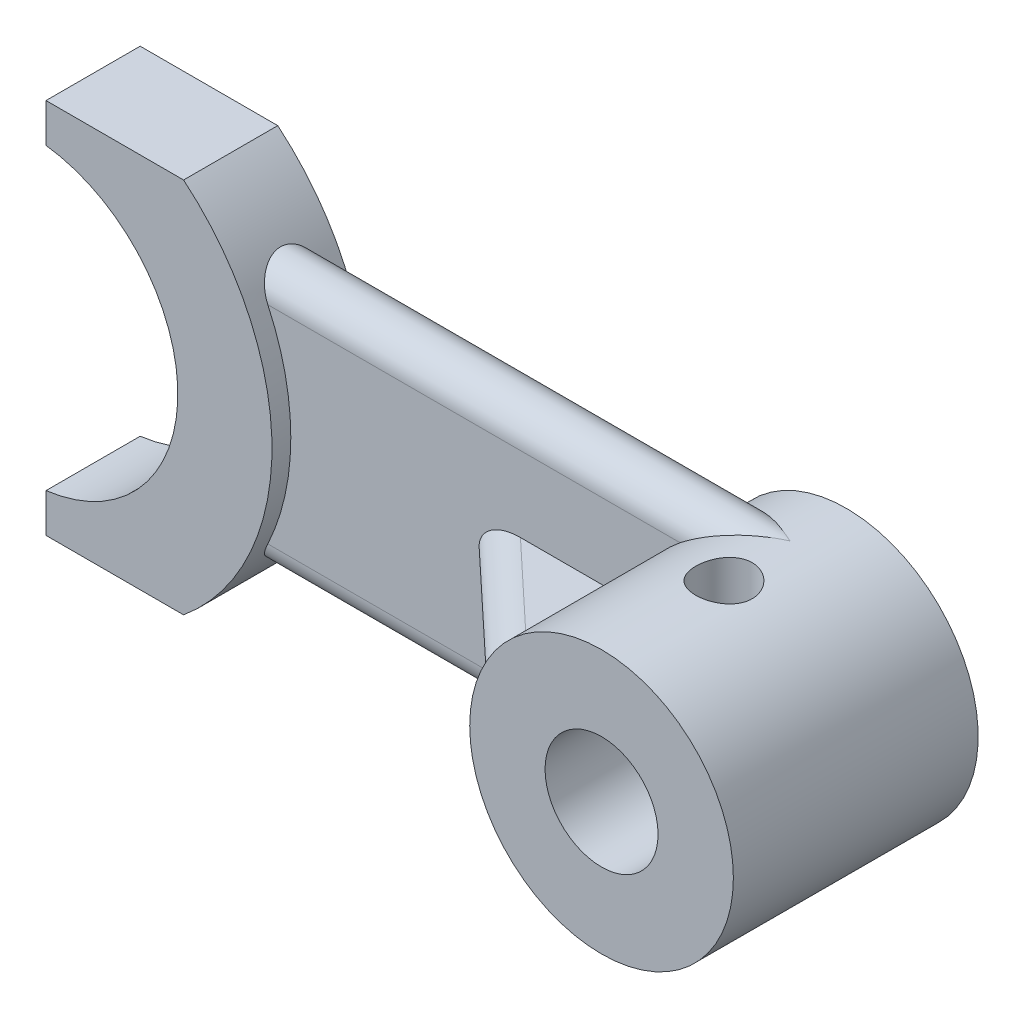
ISO-10303-21;
HEADER;
FILE_DESCRIPTION(('STEP AP214'),'2;1');
FILE_NAME('part.step','',(''),(''),'','','');
FILE_SCHEMA(('AUTOMOTIVE_DESIGN { 1 0 10303 214 1 1 1 1 }'));
ENDSEC;
DATA;
#1=APPLICATION_CONTEXT('core data for automotive mechanical design processes');
#2=APPLICATION_PROTOCOL_DEFINITION('international standard','automotive_design',2000,#1);
#3=PRODUCT_CONTEXT('',#1,'mechanical');
#4=PRODUCT('Part','Part','',(#3));
#5=PRODUCT_RELATED_PRODUCT_CATEGORY('part','',(#4));
#6=PRODUCT_DEFINITION_FORMATION('','',#4);
#7=PRODUCT_DEFINITION_CONTEXT('part definition',#1,'design');
#8=PRODUCT_DEFINITION('design','',#6,#7);
#9=PRODUCT_DEFINITION_SHAPE('','',#8);
#10=(LENGTH_UNIT() NAMED_UNIT(*) SI_UNIT(.MILLI.,.METRE.));
#11=(NAMED_UNIT(*) PLANE_ANGLE_UNIT() SI_UNIT($,.RADIAN.));
#12=(NAMED_UNIT(*) SI_UNIT($,.STERADIAN.) SOLID_ANGLE_UNIT());
#13=UNCERTAINTY_MEASURE_WITH_UNIT(LENGTH_MEASURE(1.E-05),#10,'distance_accuracy_value','');
#14=(GEOMETRIC_REPRESENTATION_CONTEXT(3) GLOBAL_UNCERTAINTY_ASSIGNED_CONTEXT((#13)) GLOBAL_UNIT_ASSIGNED_CONTEXT((#10,
#11,#12)) REPRESENTATION_CONTEXT('',''));
#15=CARTESIAN_POINT('',(0.,0.,0.));
#16=DIRECTION('',(0.,0.,1.));
#17=DIRECTION('',(1.,0.,0.));
#18=AXIS2_PLACEMENT_3D('',#15,#16,#17);
#19=CARTESIAN_POINT('',(500000.,5.5,1.5));
#20=DIRECTION('',(0.,0.,-1.));
#21=DIRECTION('',(0.,1.,0.));
#22=AXIS2_PLACEMENT_3D('',#19,#20,#21);
#23=PLANE('',#22);
#24=DIRECTION('',(1.,0.,0.));
#25=VECTOR('',#24,1.);
#26=CARTESIAN_POINT('',(500000.,-1.5,1.5));
#27=LINE('',#26,#25);
#28=CARTESIAN_POINT('',(-12.8068287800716,-1.5,1.5));
#29=VERTEX_POINT('',#28);
#30=CARTESIAN_POINT('',(-6.83739716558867,-1.5,1.5));
#31=VERTEX_POINT('',#30);
#32=EDGE_CURVE('E316',#29,#31,#27,.T.);
#33=ORIENTED_EDGE('',*,*,#32,.F.);
#34=CARTESIAN_POINT('',(-12.8068287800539,0.,1.5));
#35=DIRECTION('',(0.,0.,-1.));
#36=DIRECTION('',(-1.,0.,0.));
#37=AXIS2_PLACEMENT_3D('',#34,#35,#36);
#38=ELLIPSE('',#37,2.19317121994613,1.5);
#39=CARTESIAN_POINT('',(-15.000000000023,0.,1.49999999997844));
#40=VERTEX_POINT('',#39);
#41=EDGE_CURVE('E45',#29,#40,#38,.T.);
#42=ORIENTED_EDGE('',*,*,#41,.T.);
#43=CARTESIAN_POINT('',(-12.8068287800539,0.,1.5));
#44=DIRECTION('',(0.,0.,-1.));
#45=DIRECTION('',(1.,0.,0.));
#46=AXIS2_PLACEMENT_3D('',#43,#44,#45);
#47=ELLIPSE('',#46,2.19317121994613,1.5);
#48=CARTESIAN_POINT('',(-12.8068287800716,1.5,1.5));
#49=VERTEX_POINT('',#48);
#50=EDGE_CURVE('E281',#40,#49,#47,.T.);
#51=ORIENTED_EDGE('',*,*,#50,.T.);
#52=DIRECTION('',(1.,0.,0.));
#53=VECTOR('',#52,1.);
#54=CARTESIAN_POINT('',(500000.,1.5,1.5));
#55=LINE('',#54,#53);
#56=CARTESIAN_POINT('',(-6.83739716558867,1.5,1.5));
#57=VERTEX_POINT('',#56);
#58=EDGE_CURVE('E311',#49,#57,#55,.T.);
#59=ORIENTED_EDGE('',*,*,#58,.T.);
#60=CARTESIAN_POINT('',(0.,0.,1.5));
#61=DIRECTION('',(0.,0.,-1.));
#62=DIRECTION('',(0.,1.,0.));
#63=AXIS2_PLACEMENT_3D('',#60,#61,#62);
#64=CIRCLE('',#63,7.);
#65=CARTESIAN_POINT('',(-4.33012701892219,5.5,1.5));
#66=VERTEX_POINT('',#65);
#67=EDGE_CURVE('E315',#66,#57,#64,.F.);
#68=ORIENTED_EDGE('',*,*,#67,.F.);
#69=DIRECTION('',(-1.,0.,0.));
#70=VECTOR('',#69,1.);
#71=CARTESIAN_POINT('',(500000.,5.5,1.5));
#72=LINE('',#71,#70);
#73=CARTESIAN_POINT('',(-26.2207810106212,5.5,1.5));
#74=VERTEX_POINT('',#73);
#75=EDGE_CURVE('E255',#66,#74,#72,.T.);
#76=ORIENTED_EDGE('',*,*,#75,.T.);
#77=CARTESIAN_POINT('',(-38.,0.,1.5));
#78=DIRECTION('',(0.,0.,-1.));
#79=DIRECTION('',(0.,1.,0.));
#80=AXIS2_PLACEMENT_3D('',#77,#78,#79);
#81=CIRCLE('',#80,13.);
#82=CARTESIAN_POINT('',(-26.2207810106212,-5.5,1.5));
#83=VERTEX_POINT('',#82);
#84=EDGE_CURVE('E361',#83,#74,#81,.F.);
#85=ORIENTED_EDGE('',*,*,#84,.F.);
#86=DIRECTION('',(-1.,0.,0.));
#87=VECTOR('',#86,1.);
#88=CARTESIAN_POINT('',(500000.,-5.5,1.5));
#89=LINE('',#88,#87);
#90=CARTESIAN_POINT('',(-4.3301270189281,-5.49999999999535,1.5));
#91=VERTEX_POINT('',#90);
#92=EDGE_CURVE('E368',#91,#83,#89,.T.);
#93=ORIENTED_EDGE('',*,*,#92,.F.);
#94=EDGE_CURVE('E382',#31,#91,#64,.F.);
#95=ORIENTED_EDGE('',*,*,#94,.F.);
#96=EDGE_LOOP('',(#33,#42,#51,#59,#68,#76,#85,#93,#95));
#97=FACE_BOUND('',#96,.T.);
#98=ADVANCED_FACE('F31',(#97),#23,.F.);
#99=CARTESIAN_POINT('',(500000.,5.5,0.));
#100=DIRECTION('',(-1.,0.,0.));
#101=DIRECTION('',(0.,0.,1.));
#102=AXIS2_PLACEMENT_3D('',#99,#100,#101);
#103=CYLINDRICAL_SURFACE('',#102,1.5);
#104=CARTESIAN_POINT('',(-26.2207810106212,5.5,1.5));
#105=CARTESIAN_POINT('',(-26.2646833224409,5.59413384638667,1.50000842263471));
#106=CARTESIAN_POINT('',(-26.3097704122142,5.68764723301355,1.49114290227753));
#107=CARTESIAN_POINT('',(-26.4008489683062,5.87110485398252,1.45636385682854));
#108=CARTESIAN_POINT('',(-26.4468411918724,5.96104589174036,1.43043541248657));
#109=CARTESIAN_POINT('',(-26.5381820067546,6.13485601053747,1.3622333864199));
#110=CARTESIAN_POINT('',(-26.5835306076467,6.21872518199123,1.31996004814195));
#111=CARTESIAN_POINT('',(-26.6717770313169,6.37805890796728,1.21978021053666));
#112=CARTESIAN_POINT('',(-26.7146748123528,6.45352331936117,1.16187344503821));
#113=CARTESIAN_POINT('',(-26.7949795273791,6.59194924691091,1.03267573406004));
#114=CARTESIAN_POINT('',(-26.8324840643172,6.65514311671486,0.961696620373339));
#115=CARTESIAN_POINT('',(-26.9005879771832,6.76811726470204,0.806864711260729));
#116=CARTESIAN_POINT('',(-26.9311950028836,6.81791241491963,0.723026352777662));
#117=CARTESIAN_POINT('',(-26.9795319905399,6.89573232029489,0.556148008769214));
#118=CARTESIAN_POINT('',(-26.9984037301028,6.92571886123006,0.47435906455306));
#119=CARTESIAN_POINT('',(-27.0271521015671,6.97118019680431,0.305369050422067));
#120=CARTESIAN_POINT('',(-27.0370419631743,6.98667633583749,0.218176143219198));
#121=CARTESIAN_POINT('',(-27.0460989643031,7.00086433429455,0.0552739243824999));
#122=CARTESIAN_POINT('',(-27.0466627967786,7.00174510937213,-0.0201754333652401));
#123=CARTESIAN_POINT('',(-27.0405782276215,6.99221766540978,-0.1700531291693));
#124=CARTESIAN_POINT('',(-27.0339313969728,6.98181190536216,-0.244481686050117));
#125=CARTESIAN_POINT('',(-27.0144269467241,6.95107833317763,-0.386523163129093));
#126=CARTESIAN_POINT('',(-27.0018863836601,6.93125653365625,-0.454291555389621));
#127=CARTESIAN_POINT('',(-26.9715241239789,6.88284334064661,-0.585343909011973));
#128=CARTESIAN_POINT('',(-26.9537012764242,6.85425003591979,-0.648626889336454));
#129=CARTESIAN_POINT('',(-26.9121381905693,6.78682563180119,-0.774309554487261));
#130=CARTESIAN_POINT('',(-26.8880449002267,6.74737007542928,-0.836255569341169));
#131=CARTESIAN_POINT('',(-26.8359677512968,6.66085082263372,-0.952730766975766));
#132=CARTESIAN_POINT('',(-26.8079822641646,6.61378394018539,-1.00725682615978));
#133=CARTESIAN_POINT('',(-26.7450308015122,6.50615671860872,-1.11546613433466));
#134=CARTESIAN_POINT('',(-26.7096373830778,6.44462944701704,-1.16793901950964));
#135=CARTESIAN_POINT('',(-26.6365520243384,6.3148715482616,-1.26190794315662));
#136=CARTESIAN_POINT('',(-26.5988579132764,6.24663455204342,-1.30339341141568));
#137=CARTESIAN_POINT('',(-26.5174382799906,6.09582091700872,-1.37950011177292));
#138=CARTESIAN_POINT('',(-26.4735613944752,6.01252948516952,-1.41254825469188));
#139=CARTESIAN_POINT('',(-26.3859427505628,5.84147624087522,-1.46332974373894));
#140=CARTESIAN_POINT('',(-26.3422008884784,5.75372108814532,-1.48108523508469));
#141=CARTESIAN_POINT('',(-26.2727157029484,5.61022168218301,-1.49695561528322));
#142=CARTESIAN_POINT('',(-26.2465426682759,5.55519720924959,-1.50000641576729));
#143=CARTESIAN_POINT('',(-26.2207810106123,5.50000000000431,-1.5));
#144=B_SPLINE_CURVE_WITH_KNOTS('',3,(#104,#105,#106,#107,#108,#109,#110,#111,#112,#113,#114,
#115,#116,#117,#118,#119,#120,#121,#122,#123,#124,#125,#126,#127,#128,#129,#130,#131,#132,#133,
#134,#135,#136,#137,#138,#139,#140,#141,#142,#143),.UNSPECIFIED.,.F.,.F.,(4,2,2,2,2,2,2,2,2,2,2,
2,2,2,2,2,2,2,2,4),(0.,0.311142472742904,0.622557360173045,0.933967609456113,1.24538316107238,
1.55015619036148,1.85458952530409,2.12035677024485,2.38573191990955,2.61093037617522,
2.83607977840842,3.05030292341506,3.26457277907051,3.49555088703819,3.72662593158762,
3.99038917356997,4.25440524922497,4.55243794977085,4.85003834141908,5.03275814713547),.UNSPECIFIED.);
#145=CARTESIAN_POINT('',(-26.2207810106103,5.5,-1.5));
#146=VERTEX_POINT('',#145);
#147=EDGE_CURVE('E172',#74,#146,#144,.T.);
#148=ORIENTED_EDGE('',*,*,#147,.F.);
#149=ORIENTED_EDGE('',*,*,#75,.F.);
#150=CARTESIAN_POINT('',(-4.33012701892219,5.5,1.5));
#151=CARTESIAN_POINT('',(-4.24260031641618,5.56892895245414,1.49995203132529));
#152=CARTESIAN_POINT('',(-4.15350099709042,5.63567283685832,1.49525418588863));
#153=CARTESIAN_POINT('',(-3.97290433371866,5.76439456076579,1.47795047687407));
#154=CARTESIAN_POINT('',(-3.88141188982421,5.82638125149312,1.46535971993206));
#155=CARTESIAN_POINT('',(-3.69710207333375,5.94503015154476,1.43376510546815));
#156=CARTESIAN_POINT('',(-3.60429893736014,6.00172740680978,1.41480796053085));
#157=CARTESIAN_POINT('',(-3.41706621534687,6.1102679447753,1.37149179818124));
#158=CARTESIAN_POINT('',(-3.32263559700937,6.16210800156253,1.34712922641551));
#159=CARTESIAN_POINT('',(-3.07432953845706,6.29112969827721,1.27761538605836));
#160=CARTESIAN_POINT('',(-2.91942582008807,6.3644151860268,1.22886364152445));
#161=CARTESIAN_POINT('',(-2.60726716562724,6.4985418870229,1.12260206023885));
#162=CARTESIAN_POINT('',(-2.45001130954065,6.55937808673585,1.06508871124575));
#163=CARTESIAN_POINT('',(-2.1331617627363,6.66917153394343,0.943285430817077));
#164=CARTESIAN_POINT('',(-1.97356097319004,6.71807715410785,0.878967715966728));
#165=CARTESIAN_POINT('',(-1.65323586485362,6.80399164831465,0.745584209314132));
#166=CARTESIAN_POINT('',(-1.49251186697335,6.84100378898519,0.676519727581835));
#167=CARTESIAN_POINT('',(-1.11272833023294,6.91458292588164,0.509863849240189));
#168=CARTESIAN_POINT('',(-0.893325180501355,6.94627476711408,0.410889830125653));
#169=CARTESIAN_POINT('',(-0.454308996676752,6.988712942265,0.210276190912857));
#170=CARTESIAN_POINT('',(-0.234697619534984,6.99950751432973,0.108643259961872));
#171=CARTESIAN_POINT('',(-0.0101233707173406,6.99999450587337,0.00468620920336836));
#172=CARTESIAN_POINT('',(-0.00506165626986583,6.99999999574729,0.00234309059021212));
#173=CARTESIAN_POINT('',(0.,7.,0.));
#174=B_SPLINE_CURVE_WITH_KNOTS('',3,(#150,#151,#152,#153,#154,#155,#156,#157,#158,#159,#160,
#161,#162,#163,#164,#165,#166,#167,#168,#169,#170,#171,#172,#173),.UNSPECIFIED.,.F.,.F.,(4,2,2,
2,2,2,2,2,2,2,2,4),(0.,0.333934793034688,0.667232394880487,0.998136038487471,1.32925791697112,
1.86292919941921,2.3968149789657,2.93297162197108,3.46898087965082,4.19632705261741,
4.92199224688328,4.93872545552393),.UNSPECIFIED.);
#175=CARTESIAN_POINT('',(0.,7.,0.));
#176=VERTEX_POINT('',#175);
#177=EDGE_CURVE('E243',#176,#66,#174,.F.);
#178=ORIENTED_EDGE('',*,*,#177,.F.);
#179=CARTESIAN_POINT('',(-4.33012701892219,5.5,-1.5));
#180=CARTESIAN_POINT('',(-4.24260031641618,5.56892895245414,-1.49995203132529));
#181=CARTESIAN_POINT('',(-4.15350099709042,5.63567283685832,-1.49525418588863));
#182=CARTESIAN_POINT('',(-3.97290433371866,5.76439456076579,-1.47795047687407));
#183=CARTESIAN_POINT('',(-3.88141188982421,5.82638125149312,-1.46535971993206));
#184=CARTESIAN_POINT('',(-3.69710207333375,5.94503015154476,-1.43376510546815));
#185=CARTESIAN_POINT('',(-3.60429893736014,6.00172740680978,-1.41480796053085));
#186=CARTESIAN_POINT('',(-3.41706621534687,6.1102679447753,-1.37149179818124));
#187=CARTESIAN_POINT('',(-3.32263559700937,6.16210800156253,-1.34712922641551));
#188=CARTESIAN_POINT('',(-3.07432953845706,6.29112969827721,-1.27761538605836));
#189=CARTESIAN_POINT('',(-2.91942582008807,6.3644151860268,-1.22886364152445));
#190=CARTESIAN_POINT('',(-2.60726716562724,6.4985418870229,-1.12260206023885));
#191=CARTESIAN_POINT('',(-2.45001130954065,6.55937808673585,-1.06508871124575));
#192=CARTESIAN_POINT('',(-2.1331617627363,6.66917153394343,-0.943285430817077));
#193=CARTESIAN_POINT('',(-1.97356097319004,6.71807715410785,-0.878967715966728));
#194=CARTESIAN_POINT('',(-1.65323586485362,6.80399164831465,-0.745584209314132));
#195=CARTESIAN_POINT('',(-1.49251186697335,6.84100378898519,-0.676519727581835));
#196=CARTESIAN_POINT('',(-1.11272833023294,6.91458292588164,-0.509863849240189));
#197=CARTESIAN_POINT('',(-0.893325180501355,6.94627476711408,-0.410889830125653));
#198=CARTESIAN_POINT('',(-0.454308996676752,6.988712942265,-0.210276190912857));
#199=CARTESIAN_POINT('',(-0.234697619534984,6.99950751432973,-0.108643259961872));
#200=CARTESIAN_POINT('',(-0.0101233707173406,6.99999450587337,-0.00468620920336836));
#201=CARTESIAN_POINT('',(-0.00506165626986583,6.99999999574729,-0.00234309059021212));
#202=CARTESIAN_POINT('',(0.,7.,0.));
#203=B_SPLINE_CURVE_WITH_KNOTS('',3,(#179,#180,#181,#182,#183,#184,#185,#186,#187,#188,#189,
#190,#191,#192,#193,#194,#195,#196,#197,#198,#199,#200,#201,#202),.UNSPECIFIED.,.F.,.F.,(4,2,2,
2,2,2,2,2,2,2,2,4),(0.,0.333934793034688,0.667232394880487,0.998136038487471,1.32925791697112,
1.86292919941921,2.3968149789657,2.93297162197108,3.46898087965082,4.19632705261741,
4.92199224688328,4.93872545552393),.UNSPECIFIED.);
#204=CARTESIAN_POINT('',(-4.33012701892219,5.5,-1.5));
#205=VERTEX_POINT('',#204);
#206=EDGE_CURVE('E250',#205,#176,#203,.T.);
#207=ORIENTED_EDGE('',*,*,#206,.F.);
#208=DIRECTION('',(-1.,0.,0.));
#209=VECTOR('',#208,1.);
#210=CARTESIAN_POINT('',(500000.,5.5,-1.5));
#211=LINE('',#210,#209);
#212=EDGE_CURVE('E374',#205,#146,#211,.T.);
#213=ORIENTED_EDGE('',*,*,#212,.T.);
#214=EDGE_LOOP('',(#148,#149,#178,#207,#213));
#215=FACE_BOUND('',#214,.T.);
#216=ADVANCED_FACE('F228',(#215),#103,.T.);
#217=CARTESIAN_POINT('',(500000.,-5.5,0.));
#218=DIRECTION('',(-1.,0.,0.));
#219=DIRECTION('',(0.,0.,1.));
#220=AXIS2_PLACEMENT_3D('',#217,#218,#219);
#221=CYLINDRICAL_SURFACE('',#220,1.5);
#222=CARTESIAN_POINT('',(-26.2207810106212,-5.5,-1.5));
#223=CARTESIAN_POINT('',(-26.2646833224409,-5.59413384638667,-1.50000842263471));
#224=CARTESIAN_POINT('',(-26.3097704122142,-5.68764723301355,-1.49114290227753));
#225=CARTESIAN_POINT('',(-26.4008489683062,-5.87110485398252,-1.45636385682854));
#226=CARTESIAN_POINT('',(-26.4468411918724,-5.96104589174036,-1.43043541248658));
#227=CARTESIAN_POINT('',(-26.5381820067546,-6.13485601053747,-1.36223338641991));
#228=CARTESIAN_POINT('',(-26.5835306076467,-6.21872518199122,-1.31996004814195));
#229=CARTESIAN_POINT('',(-26.6717770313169,-6.37805890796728,-1.21978021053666));
#230=CARTESIAN_POINT('',(-26.7146748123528,-6.45352331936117,-1.16187344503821));
#231=CARTESIAN_POINT('',(-26.7949795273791,-6.59194924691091,-1.03267573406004));
#232=CARTESIAN_POINT('',(-26.8324840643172,-6.65514311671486,-0.961696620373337));
#233=CARTESIAN_POINT('',(-26.9005879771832,-6.76811726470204,-0.806864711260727));
#234=CARTESIAN_POINT('',(-26.9311950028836,-6.81791241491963,-0.723026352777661));
#235=CARTESIAN_POINT('',(-26.9795319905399,-6.89573232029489,-0.556148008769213));
#236=CARTESIAN_POINT('',(-26.9984037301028,-6.92571886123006,-0.474359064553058));
#237=CARTESIAN_POINT('',(-27.0271521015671,-6.9711801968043,-0.305369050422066));
#238=CARTESIAN_POINT('',(-27.0370419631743,-6.98667633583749,-0.218176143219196));
#239=CARTESIAN_POINT('',(-27.0460989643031,-7.00086433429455,-0.0552739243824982));
#240=CARTESIAN_POINT('',(-27.0466627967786,-7.00174510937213,0.0201754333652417));
#241=CARTESIAN_POINT('',(-27.0405782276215,-6.99221766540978,0.170053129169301));
#242=CARTESIAN_POINT('',(-27.0339313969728,-6.98181190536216,0.244481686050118));
#243=CARTESIAN_POINT('',(-27.0144269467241,-6.95107833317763,0.386523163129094));
#244=CARTESIAN_POINT('',(-27.0018863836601,-6.93125653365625,0.454291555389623));
#245=CARTESIAN_POINT('',(-26.9715241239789,-6.88284334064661,0.585343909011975));
#246=CARTESIAN_POINT('',(-26.9537012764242,-6.85425003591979,0.648626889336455));
#247=CARTESIAN_POINT('',(-26.9121381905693,-6.78682563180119,0.774309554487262));
#248=CARTESIAN_POINT('',(-26.8880449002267,-6.74737007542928,0.836255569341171));
#249=CARTESIAN_POINT('',(-26.8359677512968,-6.66085082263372,0.952730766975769));
#250=CARTESIAN_POINT('',(-26.8079822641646,-6.61378394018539,1.00725682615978));
#251=CARTESIAN_POINT('',(-26.7450308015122,-6.50615671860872,1.11546613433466));
#252=CARTESIAN_POINT('',(-26.7096373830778,-6.44462944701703,1.16793901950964));
#253=CARTESIAN_POINT('',(-26.6365520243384,-6.3148715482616,1.26190794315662));
#254=CARTESIAN_POINT('',(-26.5988579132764,-6.24663455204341,1.30339341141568));
#255=CARTESIAN_POINT('',(-26.5174382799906,-6.09582091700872,1.37950011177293));
#256=CARTESIAN_POINT('',(-26.4735613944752,-6.01252948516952,1.41254825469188));
#257=CARTESIAN_POINT('',(-26.3859427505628,-5.84147624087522,1.46332974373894));
#258=CARTESIAN_POINT('',(-26.3422008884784,-5.75372108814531,1.48108523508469));
#259=CARTESIAN_POINT('',(-26.2727157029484,-5.61022168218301,1.49695561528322));
#260=CARTESIAN_POINT('',(-26.2465426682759,-5.55519720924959,1.50000641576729));
#261=CARTESIAN_POINT('',(-26.2207810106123,-5.50000000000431,1.5));
#262=B_SPLINE_CURVE_WITH_KNOTS('',3,(#222,#223,#224,#225,#226,#227,#228,#229,#230,#231,#232,
#233,#234,#235,#236,#237,#238,#239,#240,#241,#242,#243,#244,#245,#246,#247,#248,#249,#250,#251,
#252,#253,#254,#255,#256,#257,#258,#259,#260,#261),.UNSPECIFIED.,.F.,.F.,(4,2,2,2,2,2,2,2,2,2,2,
2,2,2,2,2,2,2,2,4),(0.,0.311142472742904,0.622557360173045,0.933967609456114,1.24538316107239,
1.55015619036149,1.85458952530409,2.12035677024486,2.38573191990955,2.61093037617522,
2.83607977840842,3.05030292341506,3.26457277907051,3.4955508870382,3.72662593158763,
3.99038917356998,4.25440524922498,4.55243794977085,4.85003834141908,5.03275814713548),.UNSPECIFIED.);
#263=CARTESIAN_POINT('',(-26.2207810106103,-5.5,-1.5));
#264=VERTEX_POINT('',#263);
#265=EDGE_CURVE('E169',#264,#83,#262,.T.);
#266=ORIENTED_EDGE('',*,*,#265,.F.);
#267=DIRECTION('',(-1.,0.,0.));
#268=VECTOR('',#267,1.);
#269=CARTESIAN_POINT('',(500000.,-5.5,-1.5));
#270=LINE('',#269,#268);
#271=CARTESIAN_POINT('',(-4.33012701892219,-5.5,-1.5));
#272=VERTEX_POINT('',#271);
#273=EDGE_CURVE('E365',#272,#264,#270,.T.);
#274=ORIENTED_EDGE('',*,*,#273,.F.);
#275=CARTESIAN_POINT('',(-4.33012701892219,-5.5,-1.5));
#276=CARTESIAN_POINT('',(-4.24260031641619,-5.56892895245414,-1.49995203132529));
#277=CARTESIAN_POINT('',(-4.15350099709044,-5.6356728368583,-1.49525418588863));
#278=CARTESIAN_POINT('',(-3.9729043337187,-5.76439456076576,-1.47795047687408));
#279=CARTESIAN_POINT('',(-3.88141188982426,-5.82638125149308,-1.46535971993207));
#280=CARTESIAN_POINT('',(-3.69710207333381,-5.94503015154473,-1.43376510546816));
#281=CARTESIAN_POINT('',(-3.60429893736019,-6.00172740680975,-1.41480796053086));
#282=CARTESIAN_POINT('',(-3.41706621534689,-6.11026794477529,-1.37149179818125));
#283=CARTESIAN_POINT('',(-3.32263559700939,-6.16210800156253,-1.34712922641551));
#284=CARTESIAN_POINT('',(-3.07432953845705,-6.29112969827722,-1.27761538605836));
#285=CARTESIAN_POINT('',(-2.91942582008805,-6.36441518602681,-1.22886364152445));
#286=CARTESIAN_POINT('',(-2.60726716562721,-6.49854188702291,-1.12260206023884));
#287=CARTESIAN_POINT('',(-2.45001130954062,-6.55937808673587,-1.06508871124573));
#288=CARTESIAN_POINT('',(-2.13316176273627,-6.66917153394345,-0.943285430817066));
#289=CARTESIAN_POINT('',(-1.97356097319,-6.71807715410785,-0.878967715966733));
#290=CARTESIAN_POINT('',(-1.65323586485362,-6.80399164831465,-0.745584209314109));
#291=CARTESIAN_POINT('',(-1.49251186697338,-6.84100378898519,-0.676519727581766));
#292=CARTESIAN_POINT('',(-1.1127283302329,-6.91458292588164,-0.509863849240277));
#293=CARTESIAN_POINT('',(-0.89332518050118,-6.94627476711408,-0.410889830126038));
#294=CARTESIAN_POINT('',(-0.454308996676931,-6.988712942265,-0.210276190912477));
#295=CARTESIAN_POINT('',(-0.23469761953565,-6.99950751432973,-0.108643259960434));
#296=CARTESIAN_POINT('',(-0.0101233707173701,-6.99999450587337,-0.00468620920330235));
#297=CARTESIAN_POINT('',(-0.0050616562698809,-6.99999999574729,-0.00234309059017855));
#298=CARTESIAN_POINT('',(0.,-7.,0.));
#299=B_SPLINE_CURVE_WITH_KNOTS('',3,(#275,#276,#277,#278,#279,#280,#281,#282,#283,#284,#285,
#286,#287,#288,#289,#290,#291,#292,#293,#294,#295,#296,#297,#298),.UNSPECIFIED.,.F.,.F.,(4,2,2,
2,2,2,2,2,2,2,2,4),(0.,0.333934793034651,0.667232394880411,0.998136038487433,1.32925791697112,
1.86292919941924,2.39681497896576,2.93297162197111,3.46898087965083,4.1963270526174,
4.92199224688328,4.93872545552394),.UNSPECIFIED.);
#300=CARTESIAN_POINT('',(0.,-7.,0.));
#301=VERTEX_POINT('',#300);
#302=EDGE_CURVE('E256',#301,#272,#299,.F.);
#303=ORIENTED_EDGE('',*,*,#302,.F.);
#304=CARTESIAN_POINT('',(-4.33012701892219,-5.5,1.5));
#305=CARTESIAN_POINT('',(-4.24260031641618,-5.56892895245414,1.49995203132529));
#306=CARTESIAN_POINT('',(-4.15350099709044,-5.63567283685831,1.49525418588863));
#307=CARTESIAN_POINT('',(-3.9729043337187,-5.76439456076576,1.47795047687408));
#308=CARTESIAN_POINT('',(-3.88141188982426,-5.82638125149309,1.46535971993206));
#309=CARTESIAN_POINT('',(-3.6971020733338,-5.94503015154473,1.43376510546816));
#310=CARTESIAN_POINT('',(-3.60429893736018,-6.00172740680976,1.41480796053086));
#311=CARTESIAN_POINT('',(-3.41706621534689,-6.11026794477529,1.37149179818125));
#312=CARTESIAN_POINT('',(-3.32263559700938,-6.16210800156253,1.34712922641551));
#313=CARTESIAN_POINT('',(-3.07432953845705,-6.29112969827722,1.27761538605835));
#314=CARTESIAN_POINT('',(-2.91942582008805,-6.36441518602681,1.22886364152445));
#315=CARTESIAN_POINT('',(-2.60726716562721,-6.49854188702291,1.12260206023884));
#316=CARTESIAN_POINT('',(-2.45001130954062,-6.55937808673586,1.06508871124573));
#317=CARTESIAN_POINT('',(-2.13316176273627,-6.66917153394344,0.943285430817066));
#318=CARTESIAN_POINT('',(-1.97356097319,-6.71807715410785,0.878967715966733));
#319=CARTESIAN_POINT('',(-1.65323586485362,-6.80399164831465,0.745584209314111));
#320=CARTESIAN_POINT('',(-1.49251186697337,-6.84100378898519,0.67651972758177));
#321=CARTESIAN_POINT('',(-1.11272833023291,-6.91458292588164,0.509863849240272));
#322=CARTESIAN_POINT('',(-0.893325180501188,-6.94627476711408,0.410889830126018));
#323=CARTESIAN_POINT('',(-0.454308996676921,-6.988712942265,0.210276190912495));
#324=CARTESIAN_POINT('',(-0.234697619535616,-6.99950751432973,0.108643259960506));
#325=CARTESIAN_POINT('',(-0.0101233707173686,-6.99999450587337,0.00468620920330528));
#326=CARTESIAN_POINT('',(-0.00506165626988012,-6.99999999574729,0.00234309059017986));
#327=CARTESIAN_POINT('',(0.,-7.,0.));
#328=B_SPLINE_CURVE_WITH_KNOTS('',3,(#304,#305,#306,#307,#308,#309,#310,#311,#312,#313,#314,
#315,#316,#317,#318,#319,#320,#321,#322,#323,#324,#325,#326,#327),.UNSPECIFIED.,.F.,.F.,(4,2,2,
2,2,2,2,2,2,2,2,4),(0.,0.333934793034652,0.667232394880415,0.998136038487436,1.32925791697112,
1.86292919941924,2.39681497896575,2.9329716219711,3.46898087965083,4.1963270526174,
4.92199224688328,4.93872545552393),.UNSPECIFIED.);
#329=EDGE_CURVE('E369',#91,#301,#328,.T.);
#330=ORIENTED_EDGE('',*,*,#329,.F.);
#331=ORIENTED_EDGE('',*,*,#92,.T.);
#332=EDGE_LOOP('',(#266,#274,#303,#330,#331));
#333=FACE_BOUND('',#332,.T.);
#334=ADVANCED_FACE('F188',(#333),#221,.T.);
#335=CARTESIAN_POINT('',(500000.,-5.5,-1.5));
#336=DIRECTION('',(0.,0.,1.));
#337=DIRECTION('',(1.,0.,0.));
#338=AXIS2_PLACEMENT_3D('',#335,#336,#337);
#339=PLANE('',#338);
#340=ORIENTED_EDGE('',*,*,#212,.F.);
#341=CARTESIAN_POINT('',(0.,0.,-1.5));
#342=DIRECTION('',(0.,0.,1.));
#343=DIRECTION('',(1.,0.,0.));
#344=AXIS2_PLACEMENT_3D('',#341,#342,#343);
#345=CIRCLE('',#344,7.);
#346=EDGE_CURVE('E264',#272,#205,#345,.F.);
#347=ORIENTED_EDGE('',*,*,#346,.F.);
#348=ORIENTED_EDGE('',*,*,#273,.T.);
#349=CARTESIAN_POINT('',(-38.,0.,-1.5));
#350=DIRECTION('',(0.,0.,1.));
#351=DIRECTION('',(1.,0.,0.));
#352=AXIS2_PLACEMENT_3D('',#349,#350,#351);
#353=CIRCLE('',#352,13.);
#354=EDGE_CURVE('E273',#146,#264,#353,.F.);
#355=ORIENTED_EDGE('',*,*,#354,.F.);
#356=EDGE_LOOP('',(#340,#347,#348,#355));
#357=FACE_BOUND('',#356,.T.);
#358=ADVANCED_FACE('F217',(#357),#339,.F.);
#359=CARTESIAN_POINT('',(0.,0.,10.));
#360=DIRECTION('',(0.,0.,-1.));
#361=DIRECTION('',(-1.,0.,0.));
#362=AXIS2_PLACEMENT_3D('',#359,#360,#361);
#363=CYLINDRICAL_SURFACE('',#362,7.);
#364=CARTESIAN_POINT('',(0.,-7.,5.));
#365=CARTESIAN_POINT('',(0.0832358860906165,-6.99999846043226,4.9999971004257));
#366=CARTESIAN_POINT('',(0.166507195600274,-6.9985002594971,4.99304839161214));
#367=CARTESIAN_POINT('',(0.330687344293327,-6.99266829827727,4.96546434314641));
#368=CARTESIAN_POINT('',(0.41159440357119,-6.98833245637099,4.94481895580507));
#369=CARTESIAN_POINT('',(0.568649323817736,-6.97730831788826,4.89051563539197));
#370=CARTESIAN_POINT('',(0.644801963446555,-6.97062242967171,4.85687102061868));
#371=CARTESIAN_POINT('',(0.790378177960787,-6.95562106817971,4.77756591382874));
#372=CARTESIAN_POINT('',(0.859801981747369,-6.9473056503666,4.73190583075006));
#373=CARTESIAN_POINT('',(0.991024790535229,-6.92981369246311,4.62911970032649));
#374=CARTESIAN_POINT('',(1.05270503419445,-6.92062683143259,4.57184377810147));
#375=CARTESIAN_POINT('',(1.16566042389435,-6.90250069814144,4.4477736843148));
#376=CARTESIAN_POINT('',(1.21693467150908,-6.8935614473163,4.38097869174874));
#377=CARTESIAN_POINT('',(1.30814204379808,-6.87684116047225,4.23889424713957));
#378=CARTESIAN_POINT('',(1.34794958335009,-6.8690733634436,4.16352248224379));
#379=CARTESIAN_POINT('',(1.41428823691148,-6.85572325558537,4.00696554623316));
#380=CARTESIAN_POINT('',(1.44082087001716,-6.85014069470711,3.92578104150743));
#381=CARTESIAN_POINT('',(1.47946574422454,-6.8418980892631,3.76118891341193));
#382=CARTESIAN_POINT('',(1.49178779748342,-6.83919556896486,3.67783272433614));
#383=CARTESIAN_POINT('',(1.50231395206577,-6.83689139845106,3.51019576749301));
#384=CARTESIAN_POINT('',(1.50051971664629,-6.83728938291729,3.42591510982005));
#385=CARTESIAN_POINT('',(1.48303326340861,-6.84110276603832,3.26037531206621));
#386=CARTESIAN_POINT('',(1.46758398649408,-6.84446541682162,3.17908911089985));
#387=CARTESIAN_POINT('',(1.42361054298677,-6.85374593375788,3.02028975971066));
#388=CARTESIAN_POINT('',(1.39508566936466,-6.85966393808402,2.94277681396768));
#389=CARTESIAN_POINT('',(1.32554551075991,-6.87344080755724,2.79303712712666));
#390=CARTESIAN_POINT('',(1.2844361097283,-6.88131420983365,2.72085548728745));
#391=CARTESIAN_POINT('',(1.19096007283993,-6.89810572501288,2.58432483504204));
#392=CARTESIAN_POINT('',(1.13859196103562,-6.90702397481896,2.5199768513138));
#393=CARTESIAN_POINT('',(1.0227954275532,-6.92512718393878,2.3995406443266));
#394=CARTESIAN_POINT('',(0.95916023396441,-6.93431383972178,2.34365129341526));
#395=CARTESIAN_POINT('',(0.823317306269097,-6.95175017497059,2.24330626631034));
#396=CARTESIAN_POINT('',(0.7511094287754,-6.95999983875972,2.19885078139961));
#397=CARTESIAN_POINT('',(0.59993346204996,-6.97465778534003,2.12258932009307));
#398=CARTESIAN_POINT('',(0.520952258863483,-6.98106238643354,2.09080858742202));
#399=CARTESIAN_POINT('',(0.358603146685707,-6.99128109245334,2.04102435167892));
#400=CARTESIAN_POINT('',(0.275235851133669,-6.99509555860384,2.02301892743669));
#401=CARTESIAN_POINT('',(0.108187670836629,-6.99965306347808,2.00158378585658));
#402=CARTESIAN_POINT('',(0.0245431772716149,-7.00045336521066,1.99788228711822));
#403=CARTESIAN_POINT('',(-0.142168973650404,-6.99905248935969,2.00442457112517));
#404=CARTESIAN_POINT('',(-0.225236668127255,-6.99685150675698,2.01466744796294));
#405=CARTESIAN_POINT('',(-0.387542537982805,-6.98973143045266,2.0485822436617));
#406=CARTESIAN_POINT('',(-0.466811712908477,-6.98484105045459,2.07211236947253));
#407=CARTESIAN_POINT('',(-0.620278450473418,-6.9728892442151,2.13177694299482));
#408=CARTESIAN_POINT('',(-0.69447559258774,-6.96582763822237,2.16791243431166));
#409=CARTESIAN_POINT('',(-0.836821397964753,-6.950175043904,2.25233354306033));
#410=CARTESIAN_POINT('',(-0.90487257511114,-6.94156431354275,2.30077979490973));
#411=CARTESIAN_POINT('',(-1.0319769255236,-6.92381033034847,2.40823482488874));
#412=CARTESIAN_POINT('',(-1.091028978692,-6.91466701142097,2.46724491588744));
#413=CARTESIAN_POINT('',(-1.19952711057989,-6.89668172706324,2.59539737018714));
#414=CARTESIAN_POINT('',(-1.24878537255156,-6.88784792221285,2.6647000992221));
#415=CARTESIAN_POINT('',(-1.3349641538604,-6.87166654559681,2.81075459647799));
#416=CARTESIAN_POINT('',(-1.37188519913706,-6.86431891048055,2.88750604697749));
#417=CARTESIAN_POINT('',(-1.43209741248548,-6.8520100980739,3.0458722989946));
#418=CARTESIAN_POINT('',(-1.45546398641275,-6.84703574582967,3.12745735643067));
#419=CARTESIAN_POINT('',(-1.48812696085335,-6.84001186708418,3.29351558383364));
#420=CARTESIAN_POINT('',(-1.49742550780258,-6.83796189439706,3.37798831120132));
#421=CARTESIAN_POINT('',(-1.5015999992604,-6.83704618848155,3.54553234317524));
#422=CARTESIAN_POINT('',(-1.49677347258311,-6.83811476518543,3.62859601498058));
#423=CARTESIAN_POINT('',(-1.47349789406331,-6.8431676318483,3.79269724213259));
#424=CARTESIAN_POINT('',(-1.45504898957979,-6.84715189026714,3.87373481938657));
#425=CARTESIAN_POINT('',(-1.40519345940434,-6.85755581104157,4.03125865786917));
#426=CARTESIAN_POINT('',(-1.37382847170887,-6.86396764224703,4.10775864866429));
#427=CARTESIAN_POINT('',(-1.29906751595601,-6.87850764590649,4.25445537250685));
#428=CARTESIAN_POINT('',(-1.255670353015,-6.88663598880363,4.32465147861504));
#429=CARTESIAN_POINT('',(-1.15708290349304,-6.90389055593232,4.45821819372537));
#430=CARTESIAN_POINT('',(-1.10167987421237,-6.91303309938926,4.52142969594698));
#431=CARTESIAN_POINT('',(-0.98108655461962,-6.93117449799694,4.63775626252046));
#432=CARTESIAN_POINT('',(-0.915894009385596,-6.94017331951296,4.69086899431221));
#433=CARTESIAN_POINT('',(-0.776603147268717,-6.95714491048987,4.78611595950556));
#434=CARTESIAN_POINT('',(-0.702404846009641,-6.96510364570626,4.82810660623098));
#435=CARTESIAN_POINT('',(-0.547850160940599,-6.97895826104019,4.89895452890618));
#436=CARTESIAN_POINT('',(-0.46749910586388,-6.98485590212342,4.92782302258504));
#437=CARTESIAN_POINT('',(-0.322535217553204,-6.99284848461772,4.96635218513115));
#438=CARTESIAN_POINT('',(-0.258717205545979,-6.99551391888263,4.97894643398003));
#439=CARTESIAN_POINT('',(-0.129939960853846,-6.99909024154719,4.99577130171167));
#440=CARTESIAN_POINT('',(-0.064980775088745,-7.00000120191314,5.00000226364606));
#441=CARTESIAN_POINT('',(0.,-7.,5.));
#442=B_SPLINE_CURVE_WITH_KNOTS('',3,(#364,#365,#366,#367,#368,#369,#370,#371,#372,#373,#374,
#375,#376,#377,#378,#379,#380,#381,#382,#383,#384,#385,#386,#387,#388,#389,#390,#391,#392,#393,
#394,#395,#396,#397,#398,#399,#400,#401,#402,#403,#404,#405,#406,#407,#408,#409,#410,#411,#412,
#413,#414,#415,#416,#417,#418,#419,#420,#421,#422,#423,#424,#425,#426,#427,#428,#429,#430,#431,
#432,#433,#434,#435,#436,#437,#438,#439,#440,#441),.UNSPECIFIED.,.T.,.F.,(4,2,2,2,2,2,2,2,2,2,2,
2,2,2,2,2,2,2,2,2,2,2,2,2,2,2,2,2,2,2,2,2,2,2,2,2,2,2,4),(0.,0.249469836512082,
0.499122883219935,0.748520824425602,0.997910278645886,1.25074961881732,1.50361077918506,
1.7591442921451,2.0146485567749,2.26633008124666,2.51798195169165,2.76524475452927,
3.01252092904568,3.26169356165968,3.51089887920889,3.76527011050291,4.0196455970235,
4.27452521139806,4.52936927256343,4.77934665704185,5.02930780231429,5.27665060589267,
5.52401389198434,5.77478733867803,6.02559197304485,6.28082063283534,6.53603841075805,
6.78982240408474,7.04356767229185,7.29200680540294,7.5404432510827,7.78808499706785,
8.03575134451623,8.28822950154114,8.54076590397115,8.79641910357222,9.0518533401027,
9.24661799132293,9.44137465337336),.UNSPECIFIED.);
#443=CARTESIAN_POINT('',(0.,-7.,5.));
#444=VERTEX_POINT('',#443);
#445=EDGE_CURVE('E392',#444,#444,#442,.T.);
#446=ORIENTED_EDGE('',*,*,#445,.T.);
#447=EDGE_LOOP('',(#446));
#448=FACE_BOUND('',#447,.T.);
#449=CARTESIAN_POINT('',(0.,7.,5.));
#450=CARTESIAN_POINT('',(-0.0832358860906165,6.99999846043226,4.9999971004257));
#451=CARTESIAN_POINT('',(-0.166507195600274,6.9985002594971,4.99304839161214));
#452=CARTESIAN_POINT('',(-0.330687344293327,6.99266829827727,4.96546434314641));
#453=CARTESIAN_POINT('',(-0.41159440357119,6.98833245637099,4.94481895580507));
#454=CARTESIAN_POINT('',(-0.568649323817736,6.97730831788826,4.89051563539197));
#455=CARTESIAN_POINT('',(-0.644801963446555,6.97062242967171,4.85687102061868));
#456=CARTESIAN_POINT('',(-0.790378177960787,6.95562106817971,4.77756591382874));
#457=CARTESIAN_POINT('',(-0.859801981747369,6.9473056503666,4.73190583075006));
#458=CARTESIAN_POINT('',(-0.991024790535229,6.92981369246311,4.62911970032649));
#459=CARTESIAN_POINT('',(-1.05270503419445,6.92062683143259,4.57184377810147));
#460=CARTESIAN_POINT('',(-1.16566042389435,6.90250069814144,4.4477736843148));
#461=CARTESIAN_POINT('',(-1.21693467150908,6.8935614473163,4.38097869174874));
#462=CARTESIAN_POINT('',(-1.30814204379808,6.87684116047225,4.23889424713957));
#463=CARTESIAN_POINT('',(-1.34794958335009,6.8690733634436,4.16352248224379));
#464=CARTESIAN_POINT('',(-1.41428823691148,6.85572325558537,4.00696554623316));
#465=CARTESIAN_POINT('',(-1.44082087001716,6.85014069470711,3.92578104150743));
#466=CARTESIAN_POINT('',(-1.47946574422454,6.8418980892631,3.76118891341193));
#467=CARTESIAN_POINT('',(-1.49178779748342,6.83919556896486,3.67783272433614));
#468=CARTESIAN_POINT('',(-1.50231395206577,6.83689139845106,3.51019576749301));
#469=CARTESIAN_POINT('',(-1.50051971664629,6.83728938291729,3.42591510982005));
#470=CARTESIAN_POINT('',(-1.48303326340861,6.84110276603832,3.26037531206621));
#471=CARTESIAN_POINT('',(-1.46758398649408,6.84446541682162,3.17908911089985));
#472=CARTESIAN_POINT('',(-1.42361054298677,6.85374593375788,3.02028975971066));
#473=CARTESIAN_POINT('',(-1.39508566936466,6.85966393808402,2.94277681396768));
#474=CARTESIAN_POINT('',(-1.32554551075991,6.87344080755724,2.79303712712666));
#475=CARTESIAN_POINT('',(-1.2844361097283,6.88131420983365,2.72085548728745));
#476=CARTESIAN_POINT('',(-1.19096007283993,6.89810572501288,2.58432483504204));
#477=CARTESIAN_POINT('',(-1.13859196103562,6.90702397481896,2.5199768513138));
#478=CARTESIAN_POINT('',(-1.0227954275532,6.92512718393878,2.3995406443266));
#479=CARTESIAN_POINT('',(-0.95916023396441,6.93431383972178,2.34365129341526));
#480=CARTESIAN_POINT('',(-0.823317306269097,6.95175017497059,2.24330626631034));
#481=CARTESIAN_POINT('',(-0.7511094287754,6.95999983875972,2.19885078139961));
#482=CARTESIAN_POINT('',(-0.59993346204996,6.97465778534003,2.12258932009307));
#483=CARTESIAN_POINT('',(-0.520952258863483,6.98106238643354,2.09080858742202));
#484=CARTESIAN_POINT('',(-0.358603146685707,6.99128109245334,2.04102435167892));
#485=CARTESIAN_POINT('',(-0.275235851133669,6.99509555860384,2.02301892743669));
#486=CARTESIAN_POINT('',(-0.108187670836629,6.99965306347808,2.00158378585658));
#487=CARTESIAN_POINT('',(-0.0245431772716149,7.00045336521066,1.99788228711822));
#488=CARTESIAN_POINT('',(0.142168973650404,6.99905248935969,2.00442457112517));
#489=CARTESIAN_POINT('',(0.225236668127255,6.99685150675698,2.01466744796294));
#490=CARTESIAN_POINT('',(0.387542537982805,6.98973143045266,2.0485822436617));
#491=CARTESIAN_POINT('',(0.466811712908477,6.98484105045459,2.07211236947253));
#492=CARTESIAN_POINT('',(0.620278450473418,6.9728892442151,2.13177694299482));
#493=CARTESIAN_POINT('',(0.69447559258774,6.96582763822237,2.16791243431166));
#494=CARTESIAN_POINT('',(0.836821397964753,6.950175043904,2.25233354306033));
#495=CARTESIAN_POINT('',(0.90487257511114,6.94156431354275,2.30077979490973));
#496=CARTESIAN_POINT('',(1.0319769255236,6.92381033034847,2.40823482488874));
#497=CARTESIAN_POINT('',(1.091028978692,6.91466701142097,2.46724491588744));
#498=CARTESIAN_POINT('',(1.19952711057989,6.89668172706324,2.59539737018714));
#499=CARTESIAN_POINT('',(1.24878537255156,6.88784792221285,2.6647000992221));
#500=CARTESIAN_POINT('',(1.3349641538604,6.87166654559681,2.81075459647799));
#501=CARTESIAN_POINT('',(1.37188519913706,6.86431891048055,2.88750604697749));
#502=CARTESIAN_POINT('',(1.43209741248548,6.8520100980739,3.0458722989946));
#503=CARTESIAN_POINT('',(1.45546398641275,6.84703574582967,3.12745735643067));
#504=CARTESIAN_POINT('',(1.48812696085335,6.84001186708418,3.29351558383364));
#505=CARTESIAN_POINT('',(1.49742550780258,6.83796189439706,3.37798831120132));
#506=CARTESIAN_POINT('',(1.5015999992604,6.83704618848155,3.54553234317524));
#507=CARTESIAN_POINT('',(1.49677347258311,6.83811476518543,3.62859601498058));
#508=CARTESIAN_POINT('',(1.47349789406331,6.8431676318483,3.79269724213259));
#509=CARTESIAN_POINT('',(1.45504898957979,6.84715189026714,3.87373481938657));
#510=CARTESIAN_POINT('',(1.40519345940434,6.85755581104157,4.03125865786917));
#511=CARTESIAN_POINT('',(1.37382847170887,6.86396764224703,4.10775864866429));
#512=CARTESIAN_POINT('',(1.29906751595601,6.87850764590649,4.25445537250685));
#513=CARTESIAN_POINT('',(1.255670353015,6.88663598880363,4.32465147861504));
#514=CARTESIAN_POINT('',(1.15708290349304,6.90389055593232,4.45821819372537));
#515=CARTESIAN_POINT('',(1.10167987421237,6.91303309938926,4.52142969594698));
#516=CARTESIAN_POINT('',(0.98108655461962,6.93117449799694,4.63775626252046));
#517=CARTESIAN_POINT('',(0.915894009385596,6.94017331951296,4.69086899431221));
#518=CARTESIAN_POINT('',(0.776603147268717,6.95714491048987,4.78611595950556));
#519=CARTESIAN_POINT('',(0.702404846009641,6.96510364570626,4.82810660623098));
#520=CARTESIAN_POINT('',(0.547850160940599,6.97895826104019,4.89895452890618));
#521=CARTESIAN_POINT('',(0.46749910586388,6.98485590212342,4.92782302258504));
#522=CARTESIAN_POINT('',(0.322535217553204,6.99284848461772,4.96635218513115));
#523=CARTESIAN_POINT('',(0.258717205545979,6.99551391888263,4.97894643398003));
#524=CARTESIAN_POINT('',(0.129939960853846,6.99909024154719,4.99577130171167));
#525=CARTESIAN_POINT('',(0.064980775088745,7.00000120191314,5.00000226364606));
#526=CARTESIAN_POINT('',(0.,7.,5.));
#527=B_SPLINE_CURVE_WITH_KNOTS('',3,(#449,#450,#451,#452,#453,#454,#455,#456,#457,#458,#459,
#460,#461,#462,#463,#464,#465,#466,#467,#468,#469,#470,#471,#472,#473,#474,#475,#476,#477,#478,
#479,#480,#481,#482,#483,#484,#485,#486,#487,#488,#489,#490,#491,#492,#493,#494,#495,#496,#497,
#498,#499,#500,#501,#502,#503,#504,#505,#506,#507,#508,#509,#510,#511,#512,#513,#514,#515,#516,
#517,#518,#519,#520,#521,#522,#523,#524,#525,#526),.UNSPECIFIED.,.T.,.F.,(4,2,2,2,2,2,2,2,2,2,2,
2,2,2,2,2,2,2,2,2,2,2,2,2,2,2,2,2,2,2,2,2,2,2,2,2,2,2,4),(0.,0.249469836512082,
0.499122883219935,0.748520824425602,0.997910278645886,1.25074961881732,1.50361077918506,
1.7591442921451,2.0146485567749,2.26633008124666,2.51798195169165,2.76524475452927,
3.01252092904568,3.26169356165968,3.51089887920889,3.76527011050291,4.0196455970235,
4.27452521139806,4.52936927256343,4.77934665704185,5.02930780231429,5.27665060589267,
5.52401389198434,5.77478733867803,6.02559197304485,6.28082063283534,6.53603841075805,
6.78982240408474,7.04356767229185,7.29200680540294,7.5404432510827,7.78808499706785,
8.03575134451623,8.28822950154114,8.54076590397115,8.79641910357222,9.0518533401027,
9.24661799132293,9.44137465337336),.UNSPECIFIED.);
#528=CARTESIAN_POINT('',(0.,7.,5.));
#529=VERTEX_POINT('',#528);
#530=EDGE_CURVE('E395',#529,#529,#527,.T.);
#531=ORIENTED_EDGE('',*,*,#530,.T.);
#532=EDGE_LOOP('',(#531));
#533=FACE_BOUND('',#532,.T.);
#534=CARTESIAN_POINT('',(0.,0.,-3.));
#535=DIRECTION('',(0.,0.,-1.));
#536=DIRECTION('',(-1.,0.,0.));
#537=AXIS2_PLACEMENT_3D('',#534,#535,#536);
#538=CIRCLE('',#537,7.);
#539=CARTESIAN_POINT('',(-7.,0.,-3.));
#540=VERTEX_POINT('',#539);
#541=EDGE_CURVE('E263',#540,#540,#538,.T.);
#542=ORIENTED_EDGE('',*,*,#541,.F.);
#543=EDGE_LOOP('',(#542));
#544=FACE_BOUND('',#543,.T.);
#545=ORIENTED_EDGE('',*,*,#346,.T.);
#546=ORIENTED_EDGE('',*,*,#206,.T.);
#547=ORIENTED_EDGE('',*,*,#177,.T.);
#548=ORIENTED_EDGE('',*,*,#67,.T.);
#549=DIRECTION('',(0.,0.,-1.));
#550=VECTOR('',#549,1.);
#551=CARTESIAN_POINT('',(-6.83739716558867,1.5,10.));
#552=LINE('',#551,#550);
#553=CARTESIAN_POINT('',(-6.83739716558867,1.5,7.09634213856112));
#554=VERTEX_POINT('',#553);
#555=EDGE_CURVE('E310',#57,#554,#552,.F.);
#556=ORIENTED_EDGE('',*,*,#555,.T.);
#557=CARTESIAN_POINT('',(-6.83739716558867,1.5,7.09634213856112));
#558=CARTESIAN_POINT('',(-6.83739650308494,1.49998907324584,7.15948227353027));
#559=CARTESIAN_POINT('',(-6.83786367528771,1.49787686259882,7.2226019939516));
#560=CARTESIAN_POINT('',(-6.83975767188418,1.48920771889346,7.34859832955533));
#561=CARTESIAN_POINT('',(-6.84118571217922,1.48264515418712,7.41147453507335));
#562=CARTESIAN_POINT('',(-6.84697353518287,1.45579514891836,7.60010766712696));
#563=CARTESIAN_POINT('',(-6.85283782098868,1.4283380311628,7.72493641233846));
#564=CARTESIAN_POINT('',(-6.86675884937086,1.35962446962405,7.94450160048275));
#565=CARTESIAN_POINT('',(-6.87418078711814,1.32201692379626,8.04042339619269));
#566=CARTESIAN_POINT('',(-6.89086222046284,1.23211521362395,8.22472038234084));
#567=CARTESIAN_POINT('',(-6.90011531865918,1.17987192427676,8.31312035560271));
#568=CARTESIAN_POINT('',(-6.91786537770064,1.07035479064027,8.46501504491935));
#569=CARTESIAN_POINT('',(-6.92622754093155,1.0154070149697,8.53019747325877));
#570=CARTESIAN_POINT('',(-6.94276474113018,0.895365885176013,8.65062650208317));
#571=CARTESIAN_POINT('',(-6.95093973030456,0.830269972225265,8.70587058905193));
#572=CARTESIAN_POINT('',(-6.96620547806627,0.690607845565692,8.80419947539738));
#573=CARTESIAN_POINT('',(-6.97328839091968,0.615979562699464,8.84719801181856));
#574=CARTESIAN_POINT('',(-6.98532197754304,0.459751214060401,8.9181444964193));
#575=CARTESIAN_POINT('',(-6.99027599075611,0.378162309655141,8.9461160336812));
#576=CARTESIAN_POINT('',(-6.99582912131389,0.246411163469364,8.97710329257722));
#577=CARTESIAN_POINT('',(-6.99738386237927,0.197535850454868,8.98566977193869));
#578=CARTESIAN_POINT('',(-6.9994727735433,0.0991193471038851,8.99712268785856));
#579=CARTESIAN_POINT('',(-7.00000726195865,0.0495783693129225,9.00001089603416));
#580=CARTESIAN_POINT('',(-7.,0.,9.));
#581=B_SPLINE_CURVE_WITH_KNOTS('',3,(#557,#558,#559,#560,#561,#562,#563,#564,#565,#566,#567,
#568,#569,#570,#571,#572,#573,#574,#575,#576,#577,#578,#579,#580),.UNSPECIFIED.,.F.,.F.,(4,2,2,
2,2,2,2,2,2,2,2,4),(0.,0.189333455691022,0.378906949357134,0.760825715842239,1.06961626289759,
1.37734647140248,1.63329057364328,1.88929931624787,2.14706924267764,2.40443333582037,
2.55305722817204,2.70163474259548),.UNSPECIFIED.);
#582=CARTESIAN_POINT('',(-7.,0.,9.));
#583=VERTEX_POINT('',#582);
#584=EDGE_CURVE('E52',#554,#583,#581,.T.);
#585=ORIENTED_EDGE('',*,*,#584,.T.);
#586=CARTESIAN_POINT('',(-7.,0.,9.));
#587=CARTESIAN_POINT('',(-7.00000177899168,-0.0369522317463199,9.00000169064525));
#588=CARTESIAN_POINT('',(-6.99970703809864,-0.0738852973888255,8.99840143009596));
#589=CARTESIAN_POINT('',(-6.99854311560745,-0.147457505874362,8.99203114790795));
#590=CARTESIAN_POINT('',(-6.99767409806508,-0.184096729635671,8.98726203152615));
#591=CARTESIAN_POINT('',(-6.99424463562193,-0.292861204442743,8.96831408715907));
#592=CARTESIAN_POINT('',(-6.99086140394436,-0.364204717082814,8.94949385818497));
#593=CARTESIAN_POINT('',(-6.98228154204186,-0.50255718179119,8.9003120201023));
#594=CARTESIAN_POINT('',(-6.97708606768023,-0.56956886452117,8.86995776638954));
#595=CARTESIAN_POINT('',(-6.96542971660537,-0.697811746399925,8.79895595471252));
#596=CARTESIAN_POINT('',(-6.95896788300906,-0.759038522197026,8.75830060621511));
#597=CARTESIAN_POINT('',(-6.94509787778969,-0.877104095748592,8.6662390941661));
#598=CARTESIAN_POINT('',(-6.93766048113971,-0.933628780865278,8.61443676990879));
#599=CARTESIAN_POINT('',(-6.92275328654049,-1.0384082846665,8.50313570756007));
#600=CARTESIAN_POINT('',(-6.91528349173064,-1.08666388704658,8.44363769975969));
#601=CARTESIAN_POINT('',(-6.89984770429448,-1.18097629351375,8.30980861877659));
#602=CARTESIAN_POINT('',(-6.89196133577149,-1.22575309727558,8.23457029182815));
#603=CARTESIAN_POINT('',(-6.87746448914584,-1.3046445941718,8.0783976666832));
#604=CARTESIAN_POINT('',(-6.87085745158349,-1.33873068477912,7.99744878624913));
#605=CARTESIAN_POINT('',(-6.86050945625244,-1.39066562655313,7.8490813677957));
#606=CARTESIAN_POINT('',(-6.85645830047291,-1.41041543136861,7.78233440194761));
#607=CARTESIAN_POINT('',(-6.84949430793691,-1.44385559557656,7.64722124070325));
#608=CARTESIAN_POINT('',(-6.8465825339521,-1.45754029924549,7.57885359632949));
#609=CARTESIAN_POINT('',(-6.84195736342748,-1.47910326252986,7.44160047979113));
#610=CARTESIAN_POINT('',(-6.84023698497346,-1.48701536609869,7.37272045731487));
#611=CARTESIAN_POINT('',(-6.8379552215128,-1.4974541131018,7.23466496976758));
#612=CARTESIAN_POINT('',(-6.83739158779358,-1.49999120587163,7.16549034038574));
#613=CARTESIAN_POINT('',(-6.83739716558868,-1.5,7.09634213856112));
#614=B_SPLINE_CURVE_WITH_KNOTS('',3,(#586,#587,#588,#589,#590,#591,#592,#593,#594,#595,#596,
#597,#598,#599,#600,#601,#602,#603,#604,#605,#606,#607,#608,#609,#610,#611,#612,#613),
.UNSPECIFIED.,.F.,.F.,(4,2,2,2,2,2,2,2,2,2,2,2,2,4),(0.,0.110783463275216,0.221535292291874,
0.441939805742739,0.662203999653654,0.882635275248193,1.11282195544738,1.34298680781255,
1.60575893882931,1.86922822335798,2.07810963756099,2.28718542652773,2.49502536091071,
2.70246087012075),.UNSPECIFIED.);
#615=CARTESIAN_POINT('',(-6.83739716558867,-1.5,7.09634213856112));
#616=VERTEX_POINT('',#615);
#617=EDGE_CURVE('E11',#583,#616,#614,.T.);
#618=ORIENTED_EDGE('',*,*,#617,.T.);
#619=DIRECTION('',(0.,0.,-1.));
#620=VECTOR('',#619,1.);
#621=CARTESIAN_POINT('',(-6.83739716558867,-1.5,10.));
#622=LINE('',#621,#620);
#623=EDGE_CURVE('E319',#31,#616,#622,.F.);
#624=ORIENTED_EDGE('',*,*,#623,.F.);
#625=ORIENTED_EDGE('',*,*,#94,.T.);
#626=ORIENTED_EDGE('',*,*,#329,.T.);
#627=ORIENTED_EDGE('',*,*,#302,.T.);
#628=EDGE_LOOP('',(#545,#546,#547,#548,#556,#585,#618,#624,#625,#626,#627));
#629=FACE_BOUND('',#628,.T.);
#630=CARTESIAN_POINT('',(0.,0.,10.));
#631=DIRECTION('',(0.,0.,1.));
#632=DIRECTION('',(1.,0.,0.));
#633=AXIS2_PLACEMENT_3D('',#630,#631,#632);
#634=CIRCLE('',#633,7.);
#635=CARTESIAN_POINT('',(7.,0.,10.));
#636=VERTEX_POINT('',#635);
#637=EDGE_CURVE('E270',#636,#636,#634,.T.);
#638=ORIENTED_EDGE('',*,*,#637,.F.);
#639=EDGE_LOOP('',(#638));
#640=FACE_BOUND('',#639,.T.);
#641=ADVANCED_FACE('F219',(#448,#533,#544,#629,#640),#363,.T.);
#642=CARTESIAN_POINT('',(0.,0.,10.));
#643=DIRECTION('',(0.,0.,1.));
#644=DIRECTION('',(1.,0.,0.));
#645=AXIS2_PLACEMENT_3D('',#642,#643,#644);
#646=PLANE('',#645);
#647=CARTESIAN_POINT('',(0.,0.,10.));
#648=DIRECTION('',(0.,0.,1.));
#649=DIRECTION('',(1.,0.,0.));
#650=AXIS2_PLACEMENT_3D('',#647,#648,#649);
#651=CIRCLE('',#650,3.);
#652=CARTESIAN_POINT('',(3.,0.,10.));
#653=VERTEX_POINT('',#652);
#654=EDGE_CURVE('E267',#653,#653,#651,.T.);
#655=ORIENTED_EDGE('',*,*,#654,.F.);
#656=EDGE_LOOP('',(#655));
#657=FACE_BOUND('',#656,.T.);
#658=ORIENTED_EDGE('',*,*,#637,.T.);
#659=EDGE_LOOP('',(#658));
#660=FACE_BOUND('',#659,.T.);
#661=ADVANCED_FACE('F225',(#657,#660),#646,.T.);
#662=CARTESIAN_POINT('',(0.,0.,10.));
#663=DIRECTION('',(0.,0.,-1.));
#664=DIRECTION('',(-1.,0.,0.));
#665=AXIS2_PLACEMENT_3D('',#662,#663,#664);
#666=CYLINDRICAL_SURFACE('',#665,3.);
#667=CARTESIAN_POINT('',(0.,-3.,5.));
#668=CARTESIAN_POINT('',(0.0788579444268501,-2.99999570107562,4.99999504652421));
#669=CARTESIAN_POINT('',(0.157809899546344,-2.99685736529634,4.99374489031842));
#670=CARTESIAN_POINT('',(0.313380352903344,-2.98461234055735,4.96902067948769));
#671=CARTESIAN_POINT('',(0.389994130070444,-2.97549431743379,4.95052341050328));
#672=CARTESIAN_POINT('',(0.538400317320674,-2.95224419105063,4.90220928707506));
#673=CARTESIAN_POINT('',(0.61021020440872,-2.93813158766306,4.87243642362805));
#674=CARTESIAN_POINT('',(0.747708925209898,-2.90618664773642,4.80264406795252));
#675=CARTESIAN_POINT('',(0.813398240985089,-2.88835460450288,4.7626253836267));
#676=CARTESIAN_POINT('',(0.941261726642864,-2.84934387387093,4.67072412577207));
#677=CARTESIAN_POINT('',(1.00298281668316,-2.82802798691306,4.61827028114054));
#678=CARTESIAN_POINT('',(1.11716916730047,-2.78489955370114,4.50421778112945));
#679=CARTESIAN_POINT('',(1.16962737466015,-2.76308664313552,4.44261222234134));
#680=CARTESIAN_POINT('',(1.26787800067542,-2.71948426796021,4.30627497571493));
#681=CARTESIAN_POINT('',(1.31283800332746,-2.69782780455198,4.23089585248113));
#682=CARTESIAN_POINT('',(1.38925234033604,-2.65928968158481,4.07244899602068));
#683=CARTESIAN_POINT('',(1.4207163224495,-2.64240461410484,3.98938680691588));
#684=CARTESIAN_POINT('',(1.46719866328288,-2.61686800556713,3.82300234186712));
#685=CARTESIAN_POINT('',(1.48308878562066,-2.6077840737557,3.73999332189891));
#686=CARTESIAN_POINT('',(1.50064048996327,-2.59772834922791,3.57203174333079));
#687=CARTESIAN_POINT('',(1.50231613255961,-2.59674854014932,3.48708118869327));
#688=CARTESIAN_POINT('',(1.49203093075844,-2.60266395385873,3.32857096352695));
#689=CARTESIAN_POINT('',(1.48167683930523,-2.6086314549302,3.25486395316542));
#690=CARTESIAN_POINT('',(1.4504097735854,-2.62614343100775,3.11041713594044));
#691=CARTESIAN_POINT('',(1.42949343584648,-2.63768968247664,3.03967828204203));
#692=CARTESIAN_POINT('',(1.37731467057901,-2.66531214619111,2.90115630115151));
#693=CARTESIAN_POINT('',(1.34582260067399,-2.68148760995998,2.83348040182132));
#694=CARTESIAN_POINT('',(1.273562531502,-2.71655106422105,2.70404856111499));
#695=CARTESIAN_POINT('',(1.2327903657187,-2.73544027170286,2.64229529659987));
#696=CARTESIAN_POINT('',(1.13709908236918,-2.77669736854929,2.51821812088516));
#697=CARTESIAN_POINT('',(1.08104168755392,-2.79920265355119,2.45681468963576));
#698=CARTESIAN_POINT('',(0.95933336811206,-2.84321434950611,2.34389687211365));
#699=CARTESIAN_POINT('',(0.893677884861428,-2.86472027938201,2.29238721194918));
#700=CARTESIAN_POINT('',(0.750774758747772,-2.90552980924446,2.19847150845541));
#701=CARTESIAN_POINT('',(0.673130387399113,-2.92468476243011,2.15659929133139));
#702=CARTESIAN_POINT('',(0.510699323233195,-2.95736821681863,2.08685445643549));
#703=CARTESIAN_POINT('',(0.425918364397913,-2.9709011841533,2.05897072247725));
#704=CARTESIAN_POINT('',(0.259149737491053,-2.98986500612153,2.02028689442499));
#705=CARTESIAN_POINT('',(0.177512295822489,-2.99587407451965,2.00826314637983));
#706=CARTESIAN_POINT('',(0.0131693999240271,-3.00109520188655,1.99780290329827));
#707=CARTESIAN_POINT('',(-0.0695355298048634,-3.00031048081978,1.9993599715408));
#708=CARTESIAN_POINT('',(-0.226849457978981,-2.99236788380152,2.01531003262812));
#709=CARTESIAN_POINT('',(-0.301589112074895,-2.98570868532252,2.02869879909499));
#710=CARTESIAN_POINT('',(-0.447610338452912,-2.9673325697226,2.06635710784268));
#711=CARTESIAN_POINT('',(-0.518891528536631,-2.95561509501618,2.09062784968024));
#712=CARTESIAN_POINT('',(-0.658332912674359,-2.92776377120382,2.14999769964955));
#713=CARTESIAN_POINT('',(-0.726345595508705,-2.91151322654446,2.18538657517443));
#714=CARTESIAN_POINT('',(-0.855692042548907,-2.87615961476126,2.26566130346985));
#715=CARTESIAN_POINT('',(-0.917022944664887,-2.85705533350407,2.31055120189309));
#716=CARTESIAN_POINT('',(-1.03765153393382,-2.81562332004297,2.41364063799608));
#717=CARTESIAN_POINT('',(-1.09615811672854,-2.79316327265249,2.47271430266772));
#718=CARTESIAN_POINT('',(-1.20278448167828,-2.7489358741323,2.59988772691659));
#719=CARTESIAN_POINT('',(-1.25089707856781,-2.7271690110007,2.66799367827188));
#720=CARTESIAN_POINT('',(-1.33756187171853,-2.68576788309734,2.81546548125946));
#721=CARTESIAN_POINT('',(-1.37553824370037,-2.66628794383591,2.89521689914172));
#722=CARTESIAN_POINT('',(-1.43712423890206,-2.63361108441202,3.06126510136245));
#723=CARTESIAN_POINT('',(-1.46075237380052,-2.62040607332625,3.14755328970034));
#724=CARTESIAN_POINT('',(-1.49079253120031,-2.60342251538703,3.31536533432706));
#725=CARTESIAN_POINT('',(-1.49863949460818,-2.59886075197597,3.39655138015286));
#726=CARTESIAN_POINT('',(-1.5010337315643,-2.59748031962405,3.55917060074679));
#727=CARTESIAN_POINT('',(-1.49558676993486,-2.60065829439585,3.64060365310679));
#728=CARTESIAN_POINT('',(-1.47288918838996,-2.61356793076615,3.79322525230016));
#729=CARTESIAN_POINT('',(-1.45681247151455,-2.62264641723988,3.86465070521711));
#730=CARTESIAN_POINT('',(-1.41476303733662,-2.64556524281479,4.00371217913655));
#731=CARTESIAN_POINT('',(-1.38878713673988,-2.65940711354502,4.07134697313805));
#732=CARTESIAN_POINT('',(-1.32572361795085,-2.69142795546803,4.20593727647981));
#733=CARTESIAN_POINT('',(-1.28800670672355,-2.70983583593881,4.27254185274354));
#734=CARTESIAN_POINT('',(-1.20322645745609,-2.7485299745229,4.39891180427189));
#735=CARTESIAN_POINT('',(-1.15615825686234,-2.76881720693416,4.45867359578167));
#736=CARTESIAN_POINT('',(-1.04730498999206,-2.81193484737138,4.57721297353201));
#737=CARTESIAN_POINT('',(-0.984426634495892,-2.83477474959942,4.63498865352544));
#738=CARTESIAN_POINT('',(-0.849232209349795,-2.87816628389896,4.7393944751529));
#739=CARTESIAN_POINT('',(-0.776911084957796,-2.89871667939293,4.78601860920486));
#740=CARTESIAN_POINT('',(-0.623897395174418,-2.93547014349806,4.86685454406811));
#741=CARTESIAN_POINT('',(-0.543149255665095,-2.95164144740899,4.9009762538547));
#742=CARTESIAN_POINT('',(-0.376113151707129,-2.9775201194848,4.95471225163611));
#743=CARTESIAN_POINT('',(-0.289841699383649,-2.98724585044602,4.97436777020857));
#744=CARTESIAN_POINT('',(-0.168902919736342,-2.99543192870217,4.99084611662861));
#745=CARTESIAN_POINT('',(-0.135242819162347,-2.99714048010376,4.99427396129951));
#746=CARTESIAN_POINT('',(-0.0677275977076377,-2.99942545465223,4.99885199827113));
#747=CARTESIAN_POINT('',(-0.0338724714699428,-3.00000184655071,5.00000212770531));
#748=CARTESIAN_POINT('',(0.,-3.,5.));
#749=B_SPLINE_CURVE_WITH_KNOTS('',3,(#667,#668,#669,#670,#671,#672,#673,#674,#675,#676,#677,
#678,#679,#680,#681,#682,#683,#684,#685,#686,#687,#688,#689,#690,#691,#692,#693,#694,#695,#696,
#697,#698,#699,#700,#701,#702,#703,#704,#705,#706,#707,#708,#709,#710,#711,#712,#713,#714,#715,
#716,#717,#718,#719,#720,#721,#722,#723,#724,#725,#726,#727,#728,#729,#730,#731,#732,#733,#734,
#735,#736,#737,#738,#739,#740,#741,#742,#743,#744,#745,#746,#747,#748),.UNSPECIFIED.,.T.,.F.,(4,
2,2,2,2,2,2,2,2,2,2,2,2,2,2,2,2,2,2,2,2,2,2,2,2,2,2,2,2,2,2,2,2,2,2,2,2,2,2,2,4),(0.,
0.236436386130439,0.473322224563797,0.709293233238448,0.945245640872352,1.19547263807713,
1.44588935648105,1.71572589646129,1.98536921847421,2.23887018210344,2.49212035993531,
2.71508568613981,2.93812205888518,3.16635360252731,3.39468781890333,3.65197412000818,
3.9093830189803,4.17874533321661,4.44789325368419,4.69474935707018,4.94148846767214,
5.16910359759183,5.39674382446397,5.63089284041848,5.86514176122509,6.12239415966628,
6.37982382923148,6.64972023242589,6.91926767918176,7.1629396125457,7.40650589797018,
7.62686895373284,7.84730293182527,8.08254685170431,8.31791341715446,8.58187864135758,
8.84598575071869,9.1119602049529,9.37717362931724,9.47872920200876,9.58028757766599),.UNSPECIFIED.);
#750=CARTESIAN_POINT('',(0.,-3.,5.));
#751=VERTEX_POINT('',#750);
#752=EDGE_CURVE('E36',#751,#751,#749,.T.);
#753=ORIENTED_EDGE('',*,*,#752,.F.);
#754=EDGE_LOOP('',(#753));
#755=FACE_BOUND('',#754,.T.);
#756=CARTESIAN_POINT('',(0.,3.,5.));
#757=CARTESIAN_POINT('',(-0.0788579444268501,2.99999570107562,4.99999504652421));
#758=CARTESIAN_POINT('',(-0.157809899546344,2.99685736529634,4.99374489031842));
#759=CARTESIAN_POINT('',(-0.313380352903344,2.98461234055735,4.96902067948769));
#760=CARTESIAN_POINT('',(-0.389994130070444,2.97549431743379,4.95052341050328));
#761=CARTESIAN_POINT('',(-0.538400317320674,2.95224419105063,4.90220928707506));
#762=CARTESIAN_POINT('',(-0.61021020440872,2.93813158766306,4.87243642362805));
#763=CARTESIAN_POINT('',(-0.747708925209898,2.90618664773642,4.80264406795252));
#764=CARTESIAN_POINT('',(-0.813398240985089,2.88835460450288,4.7626253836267));
#765=CARTESIAN_POINT('',(-0.941261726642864,2.84934387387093,4.67072412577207));
#766=CARTESIAN_POINT('',(-1.00298281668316,2.82802798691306,4.61827028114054));
#767=CARTESIAN_POINT('',(-1.11716916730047,2.78489955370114,4.50421778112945));
#768=CARTESIAN_POINT('',(-1.16962737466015,2.76308664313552,4.44261222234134));
#769=CARTESIAN_POINT('',(-1.26787800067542,2.71948426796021,4.30627497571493));
#770=CARTESIAN_POINT('',(-1.31283800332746,2.69782780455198,4.23089585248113));
#771=CARTESIAN_POINT('',(-1.38925234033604,2.65928968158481,4.07244899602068));
#772=CARTESIAN_POINT('',(-1.4207163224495,2.64240461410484,3.98938680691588));
#773=CARTESIAN_POINT('',(-1.46719866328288,2.61686800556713,3.82300234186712));
#774=CARTESIAN_POINT('',(-1.48308878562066,2.6077840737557,3.73999332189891));
#775=CARTESIAN_POINT('',(-1.50064048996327,2.59772834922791,3.57203174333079));
#776=CARTESIAN_POINT('',(-1.50231613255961,2.59674854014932,3.48708118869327));
#777=CARTESIAN_POINT('',(-1.49203093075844,2.60266395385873,3.32857096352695));
#778=CARTESIAN_POINT('',(-1.48167683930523,2.6086314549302,3.25486395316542));
#779=CARTESIAN_POINT('',(-1.4504097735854,2.62614343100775,3.11041713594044));
#780=CARTESIAN_POINT('',(-1.42949343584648,2.63768968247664,3.03967828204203));
#781=CARTESIAN_POINT('',(-1.37731467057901,2.66531214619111,2.90115630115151));
#782=CARTESIAN_POINT('',(-1.34582260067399,2.68148760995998,2.83348040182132));
#783=CARTESIAN_POINT('',(-1.273562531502,2.71655106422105,2.70404856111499));
#784=CARTESIAN_POINT('',(-1.2327903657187,2.73544027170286,2.64229529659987));
#785=CARTESIAN_POINT('',(-1.13709908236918,2.77669736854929,2.51821812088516));
#786=CARTESIAN_POINT('',(-1.08104168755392,2.79920265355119,2.45681468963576));
#787=CARTESIAN_POINT('',(-0.95933336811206,2.84321434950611,2.34389687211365));
#788=CARTESIAN_POINT('',(-0.893677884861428,2.86472027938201,2.29238721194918));
#789=CARTESIAN_POINT('',(-0.750774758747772,2.90552980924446,2.19847150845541));
#790=CARTESIAN_POINT('',(-0.673130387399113,2.92468476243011,2.15659929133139));
#791=CARTESIAN_POINT('',(-0.510699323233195,2.95736821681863,2.08685445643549));
#792=CARTESIAN_POINT('',(-0.425918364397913,2.9709011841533,2.05897072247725));
#793=CARTESIAN_POINT('',(-0.259149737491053,2.98986500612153,2.02028689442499));
#794=CARTESIAN_POINT('',(-0.177512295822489,2.99587407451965,2.00826314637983));
#795=CARTESIAN_POINT('',(-0.0131693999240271,3.00109520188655,1.99780290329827));
#796=CARTESIAN_POINT('',(0.0695355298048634,3.00031048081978,1.9993599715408));
#797=CARTESIAN_POINT('',(0.226849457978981,2.99236788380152,2.01531003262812));
#798=CARTESIAN_POINT('',(0.301589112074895,2.98570868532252,2.02869879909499));
#799=CARTESIAN_POINT('',(0.447610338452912,2.9673325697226,2.06635710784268));
#800=CARTESIAN_POINT('',(0.518891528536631,2.95561509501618,2.09062784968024));
#801=CARTESIAN_POINT('',(0.658332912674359,2.92776377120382,2.14999769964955));
#802=CARTESIAN_POINT('',(0.726345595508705,2.91151322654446,2.18538657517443));
#803=CARTESIAN_POINT('',(0.855692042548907,2.87615961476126,2.26566130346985));
#804=CARTESIAN_POINT('',(0.917022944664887,2.85705533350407,2.31055120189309));
#805=CARTESIAN_POINT('',(1.03765153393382,2.81562332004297,2.41364063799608));
#806=CARTESIAN_POINT('',(1.09615811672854,2.79316327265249,2.47271430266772));
#807=CARTESIAN_POINT('',(1.20278448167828,2.7489358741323,2.59988772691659));
#808=CARTESIAN_POINT('',(1.25089707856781,2.7271690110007,2.66799367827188));
#809=CARTESIAN_POINT('',(1.33756187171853,2.68576788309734,2.81546548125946));
#810=CARTESIAN_POINT('',(1.37553824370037,2.66628794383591,2.89521689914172));
#811=CARTESIAN_POINT('',(1.43712423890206,2.63361108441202,3.06126510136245));
#812=CARTESIAN_POINT('',(1.46075237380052,2.62040607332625,3.14755328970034));
#813=CARTESIAN_POINT('',(1.49079253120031,2.60342251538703,3.31536533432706));
#814=CARTESIAN_POINT('',(1.49863949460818,2.59886075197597,3.39655138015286));
#815=CARTESIAN_POINT('',(1.5010337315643,2.59748031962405,3.55917060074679));
#816=CARTESIAN_POINT('',(1.49558676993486,2.60065829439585,3.64060365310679));
#817=CARTESIAN_POINT('',(1.47288918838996,2.61356793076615,3.79322525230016));
#818=CARTESIAN_POINT('',(1.45681247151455,2.62264641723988,3.86465070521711));
#819=CARTESIAN_POINT('',(1.41476303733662,2.64556524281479,4.00371217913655));
#820=CARTESIAN_POINT('',(1.38878713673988,2.65940711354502,4.07134697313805));
#821=CARTESIAN_POINT('',(1.32572361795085,2.69142795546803,4.20593727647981));
#822=CARTESIAN_POINT('',(1.28800670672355,2.70983583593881,4.27254185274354));
#823=CARTESIAN_POINT('',(1.20322645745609,2.7485299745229,4.39891180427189));
#824=CARTESIAN_POINT('',(1.15615825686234,2.76881720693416,4.45867359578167));
#825=CARTESIAN_POINT('',(1.04730498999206,2.81193484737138,4.57721297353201));
#826=CARTESIAN_POINT('',(0.984426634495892,2.83477474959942,4.63498865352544));
#827=CARTESIAN_POINT('',(0.849232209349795,2.87816628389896,4.7393944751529));
#828=CARTESIAN_POINT('',(0.776911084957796,2.89871667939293,4.78601860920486));
#829=CARTESIAN_POINT('',(0.623897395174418,2.93547014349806,4.86685454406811));
#830=CARTESIAN_POINT('',(0.543149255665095,2.95164144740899,4.9009762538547));
#831=CARTESIAN_POINT('',(0.376113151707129,2.9775201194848,4.95471225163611));
#832=CARTESIAN_POINT('',(0.289841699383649,2.98724585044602,4.97436777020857));
#833=CARTESIAN_POINT('',(0.168902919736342,2.99543192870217,4.99084611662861));
#834=CARTESIAN_POINT('',(0.135242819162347,2.99714048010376,4.99427396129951));
#835=CARTESIAN_POINT('',(0.0677275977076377,2.99942545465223,4.99885199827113));
#836=CARTESIAN_POINT('',(0.0338724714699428,3.00000184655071,5.00000212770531));
#837=CARTESIAN_POINT('',(0.,3.,5.));
#838=B_SPLINE_CURVE_WITH_KNOTS('',3,(#756,#757,#758,#759,#760,#761,#762,#763,#764,#765,#766,
#767,#768,#769,#770,#771,#772,#773,#774,#775,#776,#777,#778,#779,#780,#781,#782,#783,#784,#785,
#786,#787,#788,#789,#790,#791,#792,#793,#794,#795,#796,#797,#798,#799,#800,#801,#802,#803,#804,
#805,#806,#807,#808,#809,#810,#811,#812,#813,#814,#815,#816,#817,#818,#819,#820,#821,#822,#823,
#824,#825,#826,#827,#828,#829,#830,#831,#832,#833,#834,#835,#836,#837),.UNSPECIFIED.,.T.,.F.,(4,
2,2,2,2,2,2,2,2,2,2,2,2,2,2,2,2,2,2,2,2,2,2,2,2,2,2,2,2,2,2,2,2,2,2,2,2,2,2,2,4),(0.,
0.236436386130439,0.473322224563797,0.709293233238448,0.945245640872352,1.19547263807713,
1.44588935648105,1.71572589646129,1.98536921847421,2.23887018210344,2.49212035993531,
2.71508568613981,2.93812205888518,3.16635360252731,3.39468781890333,3.65197412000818,
3.9093830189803,4.17874533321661,4.44789325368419,4.69474935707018,4.94148846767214,
5.16910359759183,5.39674382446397,5.63089284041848,5.86514176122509,6.12239415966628,
6.37982382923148,6.64972023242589,6.91926767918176,7.1629396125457,7.40650589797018,
7.62686895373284,7.84730293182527,8.08254685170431,8.31791341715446,8.58187864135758,
8.84598575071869,9.1119602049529,9.37717362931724,9.47872920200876,9.58028757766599),.UNSPECIFIED.);
#839=CARTESIAN_POINT('',(0.,3.,5.));
#840=VERTEX_POINT('',#839);
#841=EDGE_CURVE('E400',#840,#840,#838,.T.);
#842=ORIENTED_EDGE('',*,*,#841,.F.);
#843=EDGE_LOOP('',(#842));
#844=FACE_BOUND('',#843,.T.);
#845=CARTESIAN_POINT('',(0.,0.,-3.));
#846=DIRECTION('',(0.,0.,-1.));
#847=DIRECTION('',(-1.,0.,0.));
#848=AXIS2_PLACEMENT_3D('',#845,#846,#847);
#849=CIRCLE('',#848,3.);
#850=CARTESIAN_POINT('',(-3.,0.,-3.));
#851=VERTEX_POINT('',#850);
#852=EDGE_CURVE('E260',#851,#851,#849,.T.);
#853=ORIENTED_EDGE('',*,*,#852,.T.);
#854=EDGE_LOOP('',(#853));
#855=FACE_BOUND('',#854,.T.);
#856=ORIENTED_EDGE('',*,*,#654,.T.);
#857=EDGE_LOOP('',(#856));
#858=FACE_BOUND('',#857,.T.);
#859=ADVANCED_FACE('F404',(#755,#844,#855,#858),#666,.F.);
#860=CARTESIAN_POINT('',(0.,0.,-3.));
#861=DIRECTION('',(0.,0.,-1.));
#862=DIRECTION('',(-1.,0.,0.));
#863=AXIS2_PLACEMENT_3D('',#860,#861,#862);
#864=PLANE('',#863);
#865=ORIENTED_EDGE('',*,*,#852,.F.);
#866=EDGE_LOOP('',(#865));
#867=FACE_BOUND('',#866,.T.);
#868=ORIENTED_EDGE('',*,*,#541,.T.);
#869=EDGE_LOOP('',(#868));
#870=FACE_BOUND('',#869,.T.);
#871=ADVANCED_FACE('F197',(#867,#870),#864,.T.);
#872=CARTESIAN_POINT('',(-38.,0.,2.5));
#873=DIRECTION('',(0.,0.,-1.));
#874=DIRECTION('',(-1.,0.,0.));
#875=AXIS2_PLACEMENT_3D('',#872,#873,#874);
#876=CYLINDRICAL_SURFACE('',#875,13.);
#877=CARTESIAN_POINT('',(-38.,0.,-2.5));
#878=DIRECTION('',(0.,0.,1.));
#879=DIRECTION('',(1.,0.,0.));
#880=AXIS2_PLACEMENT_3D('',#877,#878,#879);
#881=CIRCLE('',#880,13.);
#882=CARTESIAN_POINT('',(-29.6933761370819,-10.,-2.5));
#883=VERTEX_POINT('',#882);
#884=CARTESIAN_POINT('',(-29.6933761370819,10.,-2.5));
#885=VERTEX_POINT('',#884);
#886=EDGE_CURVE('E164',#883,#885,#881,.T.);
#887=ORIENTED_EDGE('',*,*,#886,.T.);
#888=DIRECTION('',(0.,0.,-1.));
#889=VECTOR('',#888,1.);
#890=CARTESIAN_POINT('',(-29.6933761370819,10.,2.5));
#891=LINE('',#890,#889);
#892=CARTESIAN_POINT('',(-29.6933761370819,10.,2.5));
#893=VERTEX_POINT('',#892);
#894=EDGE_CURVE('E329',#893,#885,#891,.T.);
#895=ORIENTED_EDGE('',*,*,#894,.F.);
#896=CARTESIAN_POINT('',(-38.,0.,2.5));
#897=DIRECTION('',(0.,0.,1.));
#898=DIRECTION('',(1.,0.,0.));
#899=AXIS2_PLACEMENT_3D('',#896,#897,#898);
#900=CIRCLE('',#899,13.);
#901=CARTESIAN_POINT('',(-29.6933761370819,-10.,2.5));
#902=VERTEX_POINT('',#901);
#903=EDGE_CURVE('E160',#902,#893,#900,.T.);
#904=ORIENTED_EDGE('',*,*,#903,.F.);
#905=DIRECTION('',(0.,0.,-1.));
#906=VECTOR('',#905,1.);
#907=CARTESIAN_POINT('',(-29.6933761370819,-10.,2.5));
#908=LINE('',#907,#906);
#909=EDGE_CURVE('E341',#902,#883,#908,.T.);
#910=ORIENTED_EDGE('',*,*,#909,.T.);
#911=EDGE_LOOP('',(#887,#895,#904,#910));
#912=FACE_BOUND('',#911,.T.);
#913=ORIENTED_EDGE('',*,*,#265,.T.);
#914=ORIENTED_EDGE('',*,*,#84,.T.);
#915=ORIENTED_EDGE('',*,*,#147,.T.);
#916=ORIENTED_EDGE('',*,*,#354,.T.);
#917=EDGE_LOOP('',(#913,#914,#915,#916));
#918=FACE_BOUND('',#917,.T.);
#919=ADVANCED_FACE('F192',(#912,#918),#876,.T.);
#920=CARTESIAN_POINT('',(-37.,10.,2.5));
#921=DIRECTION('',(0.,-1.,0.));
#922=DIRECTION('',(0.,0.,-1.));
#923=AXIS2_PLACEMENT_3D('',#920,#921,#922);
#924=PLANE('',#923);
#925=DIRECTION('',(-1.,0.,0.));
#926=VECTOR('',#925,1.);
#927=CARTESIAN_POINT('',(-37.,10.,-2.5));
#928=LINE('',#927,#926);
#929=CARTESIAN_POINT('',(-37.,10.,-2.5));
#930=VERTEX_POINT('',#929);
#931=EDGE_CURVE('E168',#885,#930,#928,.T.);
#932=ORIENTED_EDGE('',*,*,#931,.T.);
#933=DIRECTION('',(0.,0.,-1.));
#934=VECTOR('',#933,1.);
#935=CARTESIAN_POINT('',(-37.,10.,2.5));
#936=LINE('',#935,#934);
#937=CARTESIAN_POINT('',(-37.,10.,2.5));
#938=VERTEX_POINT('',#937);
#939=EDGE_CURVE('E148',#938,#930,#936,.T.);
#940=ORIENTED_EDGE('',*,*,#939,.F.);
#941=DIRECTION('',(-1.,0.,0.));
#942=VECTOR('',#941,1.);
#943=CARTESIAN_POINT('',(-37.,10.,2.5));
#944=LINE('',#943,#942);
#945=EDGE_CURVE('E155',#893,#938,#944,.T.);
#946=ORIENTED_EDGE('',*,*,#945,.F.);
#947=ORIENTED_EDGE('',*,*,#894,.T.);
#948=EDGE_LOOP('',(#932,#940,#946,#947));
#949=FACE_BOUND('',#948,.T.);
#950=ADVANCED_FACE('F166',(#949),#924,.F.);
#951=CARTESIAN_POINT('',(-37.,10.,2.5));
#952=DIRECTION('',(1.,0.,0.));
#953=DIRECTION('',(0.,0.,-1.));
#954=AXIS2_PLACEMENT_3D('',#951,#952,#953);
#955=PLANE('',#954);
#956=DIRECTION('',(0.,-1.,0.));
#957=VECTOR('',#956,1.);
#958=CARTESIAN_POINT('',(-37.,10.,-2.5));
#959=LINE('',#958,#957);
#960=CARTESIAN_POINT('',(-37.,7.93725393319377,-2.5));
#961=VERTEX_POINT('',#960);
#962=EDGE_CURVE('E331',#930,#961,#959,.T.);
#963=ORIENTED_EDGE('',*,*,#962,.T.);
#964=DIRECTION('',(0.,0.,-1.));
#965=VECTOR('',#964,1.);
#966=CARTESIAN_POINT('',(-37.,7.93725393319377,2.5));
#967=LINE('',#966,#965);
#968=CARTESIAN_POINT('',(-37.,7.93725393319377,2.5));
#969=VERTEX_POINT('',#968);
#970=EDGE_CURVE('E151',#969,#961,#967,.T.);
#971=ORIENTED_EDGE('',*,*,#970,.F.);
#972=DIRECTION('',(0.,-1.,0.));
#973=VECTOR('',#972,1.);
#974=CARTESIAN_POINT('',(-37.,10.,2.5));
#975=LINE('',#974,#973);
#976=EDGE_CURVE('E144',#938,#969,#975,.T.);
#977=ORIENTED_EDGE('',*,*,#976,.F.);
#978=ORIENTED_EDGE('',*,*,#939,.T.);
#979=EDGE_LOOP('',(#963,#971,#977,#978));
#980=FACE_BOUND('',#979,.T.);
#981=ADVANCED_FACE('F146',(#980),#955,.F.);
#982=CARTESIAN_POINT('',(-38.,0.,2.5));
#983=DIRECTION('',(0.,0.,-1.));
#984=DIRECTION('',(-1.,0.,0.));
#985=AXIS2_PLACEMENT_3D('',#982,#983,#984);
#986=CYLINDRICAL_SURFACE('',#985,8.);
#987=CARTESIAN_POINT('',(-38.,0.,-2.5));
#988=DIRECTION('',(0.,0.,-1.));
#989=DIRECTION('',(1.,0.,0.));
#990=AXIS2_PLACEMENT_3D('',#987,#988,#989);
#991=CIRCLE('',#990,8.);
#992=CARTESIAN_POINT('',(-37.,-7.93725393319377,-2.5));
#993=VERTEX_POINT('',#992);
#994=EDGE_CURVE('E333',#961,#993,#991,.T.);
#995=ORIENTED_EDGE('',*,*,#994,.T.);
#996=DIRECTION('',(0.,0.,-1.));
#997=VECTOR('',#996,1.);
#998=CARTESIAN_POINT('',(-37.,-7.93725393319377,2.5));
#999=LINE('',#998,#997);
#1000=CARTESIAN_POINT('',(-37.,-7.93725393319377,2.5));
#1001=VERTEX_POINT('',#1000);
#1002=EDGE_CURVE('E174',#1001,#993,#999,.T.);
#1003=ORIENTED_EDGE('',*,*,#1002,.F.);
#1004=CARTESIAN_POINT('',(-38.,0.,2.5));
#1005=DIRECTION('',(0.,0.,-1.));
#1006=DIRECTION('',(1.,0.,0.));
#1007=AXIS2_PLACEMENT_3D('',#1004,#1005,#1006);
#1008=CIRCLE('',#1007,8.);
#1009=EDGE_CURVE('E154',#969,#1001,#1008,.T.);
#1010=ORIENTED_EDGE('',*,*,#1009,.F.);
#1011=ORIENTED_EDGE('',*,*,#970,.T.);
#1012=EDGE_LOOP('',(#995,#1003,#1010,#1011));
#1013=FACE_BOUND('',#1012,.T.);
#1014=ADVANCED_FACE('F209',(#1013),#986,.F.);
#1015=CARTESIAN_POINT('',(-37.,-7.93725393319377,2.5));
#1016=DIRECTION('',(1.,0.,0.));
#1017=DIRECTION('',(0.,0.,-1.));
#1018=AXIS2_PLACEMENT_3D('',#1015,#1016,#1017);
#1019=PLANE('',#1018);
#1020=DIRECTION('',(0.,-1.,0.));
#1021=VECTOR('',#1020,1.);
#1022=CARTESIAN_POINT('',(-37.,-7.93725393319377,-2.5));
#1023=LINE('',#1022,#1021);
#1024=CARTESIAN_POINT('',(-37.,-10.,-2.5));
#1025=VERTEX_POINT('',#1024);
#1026=EDGE_CURVE('E335',#993,#1025,#1023,.T.);
#1027=ORIENTED_EDGE('',*,*,#1026,.T.);
#1028=DIRECTION('',(0.,0.,-1.));
#1029=VECTOR('',#1028,1.);
#1030=CARTESIAN_POINT('',(-37.,-10.,2.5));
#1031=LINE('',#1030,#1029);
#1032=CARTESIAN_POINT('',(-37.,-10.,2.5));
#1033=VERTEX_POINT('',#1032);
#1034=EDGE_CURVE('E344',#1033,#1025,#1031,.T.);
#1035=ORIENTED_EDGE('',*,*,#1034,.F.);
#1036=DIRECTION('',(0.,-1.,0.));
#1037=VECTOR('',#1036,1.);
#1038=CARTESIAN_POINT('',(-37.,-7.93725393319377,2.5));
#1039=LINE('',#1038,#1037);
#1040=EDGE_CURVE('E324',#1001,#1033,#1039,.T.);
#1041=ORIENTED_EDGE('',*,*,#1040,.F.);
#1042=ORIENTED_EDGE('',*,*,#1002,.T.);
#1043=EDGE_LOOP('',(#1027,#1035,#1041,#1042));
#1044=FACE_BOUND('',#1043,.T.);
#1045=ADVANCED_FACE('F205',(#1044),#1019,.F.);
#1046=CARTESIAN_POINT('',(-37.,-10.,2.5));
#1047=DIRECTION('',(0.,1.,0.));
#1048=DIRECTION('',(0.,0.,1.));
#1049=AXIS2_PLACEMENT_3D('',#1046,#1047,#1048);
#1050=PLANE('',#1049);
#1051=DIRECTION('',(1.,0.,0.));
#1052=VECTOR('',#1051,1.);
#1053=CARTESIAN_POINT('',(-37.,-10.,-2.5));
#1054=LINE('',#1053,#1052);
#1055=EDGE_CURVE('E337',#1025,#883,#1054,.T.);
#1056=ORIENTED_EDGE('',*,*,#1055,.T.);
#1057=ORIENTED_EDGE('',*,*,#909,.F.);
#1058=DIRECTION('',(1.,0.,0.));
#1059=VECTOR('',#1058,1.);
#1060=CARTESIAN_POINT('',(-37.,-10.,2.5));
#1061=LINE('',#1060,#1059);
#1062=EDGE_CURVE('E326',#1033,#902,#1061,.T.);
#1063=ORIENTED_EDGE('',*,*,#1062,.F.);
#1064=ORIENTED_EDGE('',*,*,#1034,.T.);
#1065=EDGE_LOOP('',(#1056,#1057,#1063,#1064));
#1066=FACE_BOUND('',#1065,.T.);
#1067=ADVANCED_FACE('F201',(#1066),#1050,.F.);
#1068=CARTESIAN_POINT('',(-38.,0.,2.5));
#1069=DIRECTION('',(0.,0.,1.));
#1070=DIRECTION('',(1.,0.,0.));
#1071=AXIS2_PLACEMENT_3D('',#1068,#1069,#1070);
#1072=PLANE('',#1071);
#1073=ORIENTED_EDGE('',*,*,#945,.T.);
#1074=ORIENTED_EDGE('',*,*,#976,.T.);
#1075=ORIENTED_EDGE('',*,*,#1009,.T.);
#1076=ORIENTED_EDGE('',*,*,#1040,.T.);
#1077=ORIENTED_EDGE('',*,*,#1062,.T.);
#1078=ORIENTED_EDGE('',*,*,#903,.T.);
#1079=EDGE_LOOP('',(#1073,#1074,#1075,#1076,#1077,#1078));
#1080=FACE_BOUND('',#1079,.T.);
#1081=ADVANCED_FACE('F158',(#1080),#1072,.T.);
#1082=CARTESIAN_POINT('',(-38.,0.,-2.5));
#1083=DIRECTION('',(0.,0.,1.));
#1084=DIRECTION('',(1.,0.,0.));
#1085=AXIS2_PLACEMENT_3D('',#1082,#1083,#1084);
#1086=PLANE('',#1085);
#1087=ORIENTED_EDGE('',*,*,#931,.F.);
#1088=ORIENTED_EDGE('',*,*,#886,.F.);
#1089=ORIENTED_EDGE('',*,*,#1055,.F.);
#1090=ORIENTED_EDGE('',*,*,#1026,.F.);
#1091=ORIENTED_EDGE('',*,*,#994,.F.);
#1092=ORIENTED_EDGE('',*,*,#962,.F.);
#1093=EDGE_LOOP('',(#1087,#1088,#1089,#1090,#1091,#1092));
#1094=FACE_BOUND('',#1093,.T.);
#1095=ADVANCED_FACE('F199',(#1094),#1086,.F.);
#1096=CARTESIAN_POINT('',(-15.,1.5,3.5));
#1097=DIRECTION('',(0.,1.,0.));
#1098=DIRECTION('',(0.,0.,1.));
#1099=AXIS2_PLACEMENT_3D('',#1096,#1097,#1098);
#1100=PLANE('',#1099);
#1101=ORIENTED_EDGE('',*,*,#58,.F.);
#1102=DIRECTION('',(0.729537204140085,0.,0.68394112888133));
#1103=VECTOR('',#1102,1.);
#1104=CARTESIAN_POINT('',(-12.976167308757,1.5,1.34124512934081));
#1105=LINE('',#1104,#1103);
#1106=EDGE_CURVE('E276',#49,#554,#1105,.T.);
#1107=ORIENTED_EDGE('',*,*,#1106,.T.);
#1108=ORIENTED_EDGE('',*,*,#555,.F.);
#1109=EDGE_LOOP('',(#1101,#1107,#1108));
#1110=FACE_BOUND('',#1109,.T.);
#1111=ADVANCED_FACE('F309',(#1110),#1100,.T.);
#1112=CARTESIAN_POINT('',(-15.,-1.5,3.5));
#1113=DIRECTION('',(0.,1.,0.));
#1114=DIRECTION('',(0.,0.,1.));
#1115=AXIS2_PLACEMENT_3D('',#1112,#1113,#1114);
#1116=PLANE('',#1115);
#1117=ORIENTED_EDGE('',*,*,#623,.T.);
#1118=DIRECTION('',(0.729537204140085,0.,0.68394112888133));
#1119=VECTOR('',#1118,1.);
#1120=CARTESIAN_POINT('',(-13.9740883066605,-1.5,0.405694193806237));
#1121=LINE('',#1120,#1119);
#1122=EDGE_CURVE('E279',#616,#29,#1121,.F.);
#1123=ORIENTED_EDGE('',*,*,#1122,.T.);
#1124=ORIENTED_EDGE('',*,*,#32,.T.);
#1125=EDGE_LOOP('',(#1117,#1123,#1124));
#1126=FACE_BOUND('',#1125,.T.);
#1127=ADVANCED_FACE('F300',(#1126),#1116,.F.);
#1128=CARTESIAN_POINT('',(-12.976167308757,0.,1.34124512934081));
#1129=DIRECTION('',(-0.729537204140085,0.,-0.68394112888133));
#1130=DIRECTION('',(-0.68394112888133,0.,0.729537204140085));
#1131=AXIS2_PLACEMENT_3D('',#1128,#1129,#1130);
#1132=CYLINDRICAL_SURFACE('',#1131,1.5);
#1133=ORIENTED_EDGE('',*,*,#1122,.F.);
#1134=ORIENTED_EDGE('',*,*,#617,.F.);
#1135=DIRECTION('',(-0.729537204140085,0.,-0.68394112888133));
#1136=VECTOR('',#1135,1.);
#1137=CARTESIAN_POINT('',(-6.83739716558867,0.,9.15244015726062));
#1138=LINE('',#1137,#1136);
#1139=EDGE_CURVE('E305',#40,#583,#1138,.F.);
#1140=ORIENTED_EDGE('',*,*,#1139,.F.);
#1141=ORIENTED_EDGE('',*,*,#41,.F.);
#1142=EDGE_LOOP('',(#1133,#1134,#1140,#1141));
#1143=FACE_BOUND('',#1142,.T.);
#1144=ADVANCED_FACE('F33',(#1143),#1132,.T.);
#1145=CARTESIAN_POINT('',(-5.974088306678,0.,7.90569419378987));
#1146=DIRECTION('',(0.729537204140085,0.,0.68394112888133));
#1147=DIRECTION('',(0.68394112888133,0.,-0.729537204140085));
#1148=AXIS2_PLACEMENT_3D('',#1145,#1146,#1147);
#1149=CYLINDRICAL_SURFACE('',#1148,1.5);
#1150=ORIENTED_EDGE('',*,*,#584,.F.);
#1151=ORIENTED_EDGE('',*,*,#1106,.F.);
#1152=ORIENTED_EDGE('',*,*,#50,.F.);
#1153=ORIENTED_EDGE('',*,*,#1139,.T.);
#1154=EDGE_LOOP('',(#1150,#1151,#1152,#1153));
#1155=FACE_BOUND('',#1154,.T.);
#1156=ADVANCED_FACE('F289',(#1155),#1149,.T.);
#1157=CARTESIAN_POINT('',(0.,-10.,3.5));
#1158=DIRECTION('',(0.,1.,0.));
#1159=DIRECTION('',(0.,0.,1.));
#1160=AXIS2_PLACEMENT_3D('',#1157,#1158,#1159);
#1161=CYLINDRICAL_SURFACE('',#1160,1.5);
#1162=ORIENTED_EDGE('',*,*,#841,.T.);
#1163=EDGE_LOOP('',(#1162));
#1164=FACE_BOUND('',#1163,.T.);
#1165=ORIENTED_EDGE('',*,*,#530,.F.);
#1166=EDGE_LOOP('',(#1165));
#1167=FACE_BOUND('',#1166,.T.);
#1168=ADVANCED_FACE('F292',(#1164,#1167),#1161,.F.);
#1169=ORIENTED_EDGE('',*,*,#752,.T.);
#1170=EDGE_LOOP('',(#1169));
#1171=FACE_BOUND('',#1170,.T.);
#1172=ORIENTED_EDGE('',*,*,#445,.F.);
#1173=EDGE_LOOP('',(#1172));
#1174=FACE_BOUND('',#1173,.T.);
#1175=ADVANCED_FACE('F298',(#1171,#1174),#1161,.F.);
#1176=CLOSED_SHELL('',(#98,#216,#334,#358,#641,#661,#859,#871,#919,#950,#981,#1014,#1045,#1067,
#1081,#1095,#1111,#1127,#1144,#1156,#1168,#1175));
#1177=MANIFOLD_SOLID_BREP('B2',#1176);
#1178=ADVANCED_BREP_SHAPE_REPRESENTATION('',(#18,#1177),#14);
#1179=SHAPE_DEFINITION_REPRESENTATION(#9,#1178);
ENDSEC;
END-ISO-10303-21;
